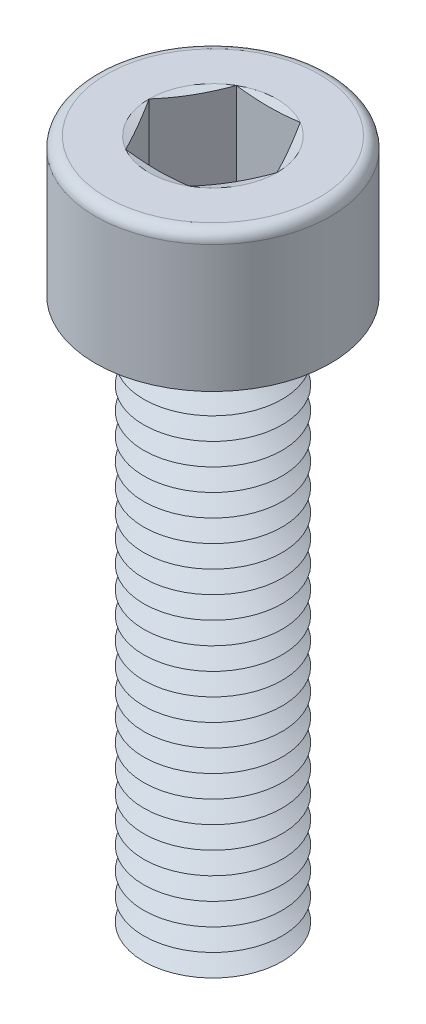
ISO-10303-21;
HEADER;
FILE_DESCRIPTION(('STEP AP214'),'2;1');
FILE_NAME('part.step','',(''),(''),'','','');
FILE_SCHEMA(('AUTOMOTIVE_DESIGN { 1 0 10303 214 1 1 1 1 }'));
ENDSEC;
DATA;
#1=APPLICATION_CONTEXT('core data for automotive mechanical design processes');
#2=APPLICATION_PROTOCOL_DEFINITION('international standard','automotive_design',2000,#1);
#3=PRODUCT_CONTEXT('',#1,'mechanical');
#4=PRODUCT('Part','Part','',(#3));
#5=PRODUCT_RELATED_PRODUCT_CATEGORY('part','',(#4));
#6=PRODUCT_DEFINITION_FORMATION('','',#4);
#7=PRODUCT_DEFINITION_CONTEXT('part definition',#1,'design');
#8=PRODUCT_DEFINITION('design','',#6,#7);
#9=PRODUCT_DEFINITION_SHAPE('','',#8);
#10=(LENGTH_UNIT() NAMED_UNIT(*) SI_UNIT(.MILLI.,.METRE.));
#11=(NAMED_UNIT(*) PLANE_ANGLE_UNIT() SI_UNIT($,.RADIAN.));
#12=(NAMED_UNIT(*) SI_UNIT($,.STERADIAN.) SOLID_ANGLE_UNIT());
#13=UNCERTAINTY_MEASURE_WITH_UNIT(LENGTH_MEASURE(1.E-05),#10,'distance_accuracy_value','');
#14=(GEOMETRIC_REPRESENTATION_CONTEXT(3) GLOBAL_UNCERTAINTY_ASSIGNED_CONTEXT((#13)) GLOBAL_UNIT_ASSIGNED_CONTEXT((#10,
#11,#12)) REPRESENTATION_CONTEXT('',''));
#15=CARTESIAN_POINT('',(0.,0.,0.));
#16=DIRECTION('',(0.,0.,1.));
#17=DIRECTION('',(1.,0.,0.));
#18=AXIS2_PLACEMENT_3D('',#15,#16,#17);
#19=CARTESIAN_POINT('',(0.,3.2,0.));
#20=DIRECTION('',(0.,1.,0.));
#21=DIRECTION('',(0.,0.,1.));
#22=AXIS2_PLACEMENT_3D('',#19,#20,#21);
#23=CONICAL_SURFACE('',#22,1.80717967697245,1.0471975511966);
#24=CARTESIAN_POINT('',(0.,3.6,0.));
#25=DIRECTION('',(0.,1.,0.));
#26=DIRECTION('',(0.,0.,1.));
#27=AXIS2_PLACEMENT_3D('',#24,#25,#26);
#28=CIRCLE('',#27,2.5);
#29=CARTESIAN_POINT('',(0.,3.6,2.5));
#30=VERTEX_POINT('',#29);
#31=EDGE_CURVE('E510',#30,#30,#28,.T.);
#32=ORIENTED_EDGE('',*,*,#31,.F.);
#33=EDGE_LOOP('',(#32));
#34=FACE_BOUND('',#33,.T.);
#35=CARTESIAN_POINT('',(0.,3.2,0.));
#36=DIRECTION('',(0.,1.,0.));
#37=DIRECTION('',(0.,0.,1.));
#38=AXIS2_PLACEMENT_3D('',#35,#36,#37);
#39=CIRCLE('',#38,1.80717967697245);
#40=CARTESIAN_POINT('',(0.,3.2,1.80717967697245));
#41=VERTEX_POINT('',#40);
#42=EDGE_CURVE('E514',#41,#41,#39,.T.);
#43=ORIENTED_EDGE('',*,*,#42,.T.);
#44=EDGE_LOOP('',(#43));
#45=FACE_BOUND('',#44,.T.);
#46=ADVANCED_FACE('F41',(#34,#45),#23,.T.);
#47=CARTESIAN_POINT('',(0.,2.8,0.));
#48=DIRECTION('',(0.,-1.,0.));
#49=DIRECTION('',(0.,0.,-1.));
#50=AXIS2_PLACEMENT_3D('',#47,#48,#49);
#51=CONICAL_SURFACE('',#50,2.5,1.0471975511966);
#52=ORIENTED_EDGE('',*,*,#42,.F.);
#53=EDGE_LOOP('',(#52));
#54=FACE_BOUND('',#53,.T.);
#55=CARTESIAN_POINT('',(0.,2.8,0.));
#56=DIRECTION('',(0.,1.,0.));
#57=DIRECTION('',(0.,0.,1.));
#58=AXIS2_PLACEMENT_3D('',#55,#56,#57);
#59=CIRCLE('',#58,2.5);
#60=CARTESIAN_POINT('',(0.,2.8,2.5));
#61=VERTEX_POINT('',#60);
#62=EDGE_CURVE('E518',#61,#61,#59,.T.);
#63=ORIENTED_EDGE('',*,*,#62,.T.);
#64=EDGE_LOOP('',(#63));
#65=FACE_BOUND('',#64,.T.);
#66=ADVANCED_FACE('F250',(#54,#65),#51,.T.);
#67=CARTESIAN_POINT('',(0.,0.,0.));
#68=DIRECTION('',(0.,1.,0.));
#69=DIRECTION('',(0.,0.,1.));
#70=AXIS2_PLACEMENT_3D('',#67,#68,#69);
#71=PLANE('',#70);
#72=CARTESIAN_POINT('',(0.,0.,0.));
#73=DIRECTION('',(0.,1.,0.));
#74=DIRECTION('',(0.,0.,1.));
#75=AXIS2_PLACEMENT_3D('',#72,#73,#74);
#76=CIRCLE('',#75,1.80717967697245);
#77=CARTESIAN_POINT('',(0.,0.,1.80717967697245));
#78=VERTEX_POINT('',#77);
#79=EDGE_CURVE('E546',#78,#78,#76,.T.);
#80=ORIENTED_EDGE('',*,*,#79,.F.);
#81=EDGE_LOOP('',(#80));
#82=FACE_BOUND('',#81,.T.);
#83=ADVANCED_FACE('F247',(#82),#71,.F.);
#84=CARTESIAN_POINT('',(0.,0.,0.));
#85=DIRECTION('',(0.,1.,0.));
#86=DIRECTION('',(0.,0.,1.));
#87=AXIS2_PLACEMENT_3D('',#84,#85,#86);
#88=CONICAL_SURFACE('',#87,1.80717967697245,1.0471975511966);
#89=CARTESIAN_POINT('',(0.,0.399999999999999,0.));
#90=DIRECTION('',(0.,1.,0.));
#91=DIRECTION('',(0.,0.,1.));
#92=AXIS2_PLACEMENT_3D('',#89,#90,#91);
#93=CIRCLE('',#92,2.5);
#94=CARTESIAN_POINT('',(0.,0.399999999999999,2.5));
#95=VERTEX_POINT('',#94);
#96=EDGE_CURVE('E542',#95,#95,#93,.T.);
#97=ORIENTED_EDGE('',*,*,#96,.F.);
#98=EDGE_LOOP('',(#97));
#99=FACE_BOUND('',#98,.T.);
#100=ORIENTED_EDGE('',*,*,#79,.T.);
#101=EDGE_LOOP('',(#100));
#102=FACE_BOUND('',#101,.T.);
#103=ADVANCED_FACE('F249',(#99,#102),#88,.T.);
#104=CARTESIAN_POINT('',(0.,0.399999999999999,0.));
#105=DIRECTION('',(0.,-1.,0.));
#106=DIRECTION('',(0.,0.,-1.));
#107=AXIS2_PLACEMENT_3D('',#104,#105,#106);
#108=CONICAL_SURFACE('',#107,2.5,1.0471975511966);
#109=CARTESIAN_POINT('',(0.,0.8,0.));
#110=DIRECTION('',(0.,1.,0.));
#111=DIRECTION('',(0.,0.,1.));
#112=AXIS2_PLACEMENT_3D('',#109,#110,#111);
#113=CIRCLE('',#112,1.80717967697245);
#114=CARTESIAN_POINT('',(0.,0.8,1.80717967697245));
#115=VERTEX_POINT('',#114);
#116=EDGE_CURVE('E538',#115,#115,#113,.T.);
#117=ORIENTED_EDGE('',*,*,#116,.F.);
#118=EDGE_LOOP('',(#117));
#119=FACE_BOUND('',#118,.T.);
#120=ORIENTED_EDGE('',*,*,#96,.T.);
#121=EDGE_LOOP('',(#120));
#122=FACE_BOUND('',#121,.T.);
#123=ADVANCED_FACE('F290',(#119,#122),#108,.T.);
#124=CARTESIAN_POINT('',(0.,0.8,0.));
#125=DIRECTION('',(0.,1.,0.));
#126=DIRECTION('',(0.,0.,1.));
#127=AXIS2_PLACEMENT_3D('',#124,#125,#126);
#128=CONICAL_SURFACE('',#127,1.80717967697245,1.0471975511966);
#129=CARTESIAN_POINT('',(0.,1.2,0.));
#130=DIRECTION('',(0.,1.,0.));
#131=DIRECTION('',(0.,0.,1.));
#132=AXIS2_PLACEMENT_3D('',#129,#130,#131);
#133=CIRCLE('',#132,2.5);
#134=CARTESIAN_POINT('',(0.,1.2,2.5));
#135=VERTEX_POINT('',#134);
#136=EDGE_CURVE('E534',#135,#135,#133,.T.);
#137=ORIENTED_EDGE('',*,*,#136,.F.);
#138=EDGE_LOOP('',(#137));
#139=FACE_BOUND('',#138,.T.);
#140=ORIENTED_EDGE('',*,*,#116,.T.);
#141=EDGE_LOOP('',(#140));
#142=FACE_BOUND('',#141,.T.);
#143=ADVANCED_FACE('F285',(#139,#142),#128,.T.);
#144=CARTESIAN_POINT('',(0.,1.2,0.));
#145=DIRECTION('',(0.,-1.,0.));
#146=DIRECTION('',(0.,0.,-1.));
#147=AXIS2_PLACEMENT_3D('',#144,#145,#146);
#148=CONICAL_SURFACE('',#147,2.5,1.0471975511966);
#149=CARTESIAN_POINT('',(0.,1.6,0.));
#150=DIRECTION('',(0.,1.,0.));
#151=DIRECTION('',(0.,0.,1.));
#152=AXIS2_PLACEMENT_3D('',#149,#150,#151);
#153=CIRCLE('',#152,1.80717967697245);
#154=CARTESIAN_POINT('',(0.,1.6,1.80717967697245));
#155=VERTEX_POINT('',#154);
#156=EDGE_CURVE('E530',#155,#155,#153,.T.);
#157=ORIENTED_EDGE('',*,*,#156,.F.);
#158=EDGE_LOOP('',(#157));
#159=FACE_BOUND('',#158,.T.);
#160=ORIENTED_EDGE('',*,*,#136,.T.);
#161=EDGE_LOOP('',(#160));
#162=FACE_BOUND('',#161,.T.);
#163=ADVANCED_FACE('F282',(#159,#162),#148,.T.);
#164=CARTESIAN_POINT('',(0.,1.6,0.));
#165=DIRECTION('',(0.,1.,0.));
#166=DIRECTION('',(0.,0.,1.));
#167=AXIS2_PLACEMENT_3D('',#164,#165,#166);
#168=CONICAL_SURFACE('',#167,1.80717967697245,1.0471975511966);
#169=CARTESIAN_POINT('',(0.,2.,0.));
#170=DIRECTION('',(0.,1.,0.));
#171=DIRECTION('',(0.,0.,1.));
#172=AXIS2_PLACEMENT_3D('',#169,#170,#171);
#173=CIRCLE('',#172,2.5);
#174=CARTESIAN_POINT('',(0.,2.,2.5));
#175=VERTEX_POINT('',#174);
#176=EDGE_CURVE('E526',#175,#175,#173,.T.);
#177=ORIENTED_EDGE('',*,*,#176,.F.);
#178=EDGE_LOOP('',(#177));
#179=FACE_BOUND('',#178,.T.);
#180=ORIENTED_EDGE('',*,*,#156,.T.);
#181=EDGE_LOOP('',(#180));
#182=FACE_BOUND('',#181,.T.);
#183=ADVANCED_FACE('F276',(#179,#182),#168,.T.);
#184=CARTESIAN_POINT('',(0.,2.,0.));
#185=DIRECTION('',(0.,-1.,0.));
#186=DIRECTION('',(0.,0.,-1.));
#187=AXIS2_PLACEMENT_3D('',#184,#185,#186);
#188=CONICAL_SURFACE('',#187,2.5,1.0471975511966);
#189=CARTESIAN_POINT('',(0.,2.4,0.));
#190=DIRECTION('',(0.,1.,0.));
#191=DIRECTION('',(0.,0.,1.));
#192=AXIS2_PLACEMENT_3D('',#189,#190,#191);
#193=CIRCLE('',#192,1.80717967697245);
#194=CARTESIAN_POINT('',(0.,2.4,1.80717967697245));
#195=VERTEX_POINT('',#194);
#196=EDGE_CURVE('E522',#195,#195,#193,.T.);
#197=ORIENTED_EDGE('',*,*,#196,.F.);
#198=EDGE_LOOP('',(#197));
#199=FACE_BOUND('',#198,.T.);
#200=ORIENTED_EDGE('',*,*,#176,.T.);
#201=EDGE_LOOP('',(#200));
#202=FACE_BOUND('',#201,.T.);
#203=ADVANCED_FACE('F272',(#199,#202),#188,.T.);
#204=CARTESIAN_POINT('',(0.,2.4,0.));
#205=DIRECTION('',(0.,1.,0.));
#206=DIRECTION('',(0.,0.,1.));
#207=AXIS2_PLACEMENT_3D('',#204,#205,#206);
#208=CONICAL_SURFACE('',#207,1.80717967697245,1.0471975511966);
#209=ORIENTED_EDGE('',*,*,#62,.F.);
#210=EDGE_LOOP('',(#209));
#211=FACE_BOUND('',#210,.T.);
#212=ORIENTED_EDGE('',*,*,#196,.T.);
#213=EDGE_LOOP('',(#212));
#214=FACE_BOUND('',#213,.T.);
#215=ADVANCED_FACE('F275',(#211,#214),#208,.T.);
#216=CARTESIAN_POINT('',(0.,4.,0.));
#217=DIRECTION('',(0.,1.,0.));
#218=DIRECTION('',(0.,0.,1.));
#219=AXIS2_PLACEMENT_3D('',#216,#217,#218);
#220=CONICAL_SURFACE('',#219,1.80717967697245,1.0471975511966);
#221=CARTESIAN_POINT('',(0.,4.4,0.));
#222=DIRECTION('',(0.,1.,0.));
#223=DIRECTION('',(0.,0.,1.));
#224=AXIS2_PLACEMENT_3D('',#221,#222,#223);
#225=CIRCLE('',#224,2.5);
#226=CARTESIAN_POINT('',(0.,4.4,2.5));
#227=VERTEX_POINT('',#226);
#228=EDGE_CURVE('E502',#227,#227,#225,.T.);
#229=ORIENTED_EDGE('',*,*,#228,.F.);
#230=EDGE_LOOP('',(#229));
#231=FACE_BOUND('',#230,.T.);
#232=CARTESIAN_POINT('',(0.,4.,0.));
#233=DIRECTION('',(0.,1.,0.));
#234=DIRECTION('',(0.,0.,1.));
#235=AXIS2_PLACEMENT_3D('',#232,#233,#234);
#236=CIRCLE('',#235,1.80717967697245);
#237=CARTESIAN_POINT('',(0.,4.,1.80717967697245));
#238=VERTEX_POINT('',#237);
#239=EDGE_CURVE('E506',#238,#238,#236,.T.);
#240=ORIENTED_EDGE('',*,*,#239,.T.);
#241=EDGE_LOOP('',(#240));
#242=FACE_BOUND('',#241,.T.);
#243=ADVANCED_FACE('F280',(#231,#242),#220,.T.);
#244=CARTESIAN_POINT('',(0.,3.6,0.));
#245=DIRECTION('',(0.,-1.,0.));
#246=DIRECTION('',(0.,0.,-1.));
#247=AXIS2_PLACEMENT_3D('',#244,#245,#246);
#248=CONICAL_SURFACE('',#247,2.5,1.0471975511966);
#249=ORIENTED_EDGE('',*,*,#239,.F.);
#250=EDGE_LOOP('',(#249));
#251=FACE_BOUND('',#250,.T.);
#252=ORIENTED_EDGE('',*,*,#31,.T.);
#253=EDGE_LOOP('',(#252));
#254=FACE_BOUND('',#253,.T.);
#255=ADVANCED_FACE('F786',(#251,#254),#248,.T.);
#256=CARTESIAN_POINT('',(0.,4.8,0.));
#257=DIRECTION('',(0.,1.,0.));
#258=DIRECTION('',(0.,0.,1.));
#259=AXIS2_PLACEMENT_3D('',#256,#257,#258);
#260=CONICAL_SURFACE('',#259,1.80717967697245,1.0471975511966);
#261=CARTESIAN_POINT('',(0.,5.2,0.));
#262=DIRECTION('',(0.,1.,0.));
#263=DIRECTION('',(0.,0.,1.));
#264=AXIS2_PLACEMENT_3D('',#261,#262,#263);
#265=CIRCLE('',#264,2.5);
#266=CARTESIAN_POINT('',(0.,5.2,2.5));
#267=VERTEX_POINT('',#266);
#268=EDGE_CURVE('E494',#267,#267,#265,.T.);
#269=ORIENTED_EDGE('',*,*,#268,.F.);
#270=EDGE_LOOP('',(#269));
#271=FACE_BOUND('',#270,.T.);
#272=CARTESIAN_POINT('',(0.,4.8,0.));
#273=DIRECTION('',(0.,1.,0.));
#274=DIRECTION('',(0.,0.,1.));
#275=AXIS2_PLACEMENT_3D('',#272,#273,#274);
#276=CIRCLE('',#275,1.80717967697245);
#277=CARTESIAN_POINT('',(0.,4.8,1.80717967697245));
#278=VERTEX_POINT('',#277);
#279=EDGE_CURVE('E498',#278,#278,#276,.T.);
#280=ORIENTED_EDGE('',*,*,#279,.T.);
#281=EDGE_LOOP('',(#280));
#282=FACE_BOUND('',#281,.T.);
#283=ADVANCED_FACE('F795',(#271,#282),#260,.T.);
#284=CARTESIAN_POINT('',(0.,4.4,0.));
#285=DIRECTION('',(0.,-1.,0.));
#286=DIRECTION('',(0.,0.,-1.));
#287=AXIS2_PLACEMENT_3D('',#284,#285,#286);
#288=CONICAL_SURFACE('',#287,2.5,1.0471975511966);
#289=ORIENTED_EDGE('',*,*,#279,.F.);
#290=EDGE_LOOP('',(#289));
#291=FACE_BOUND('',#290,.T.);
#292=ORIENTED_EDGE('',*,*,#228,.T.);
#293=EDGE_LOOP('',(#292));
#294=FACE_BOUND('',#293,.T.);
#295=ADVANCED_FACE('F805',(#291,#294),#288,.T.);
#296=CARTESIAN_POINT('',(0.,5.6,0.));
#297=DIRECTION('',(0.,1.,0.));
#298=DIRECTION('',(0.,0.,1.));
#299=AXIS2_PLACEMENT_3D('',#296,#297,#298);
#300=CONICAL_SURFACE('',#299,1.80717967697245,1.0471975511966);
#301=CARTESIAN_POINT('',(0.,6.,0.));
#302=DIRECTION('',(0.,1.,0.));
#303=DIRECTION('',(0.,0.,1.));
#304=AXIS2_PLACEMENT_3D('',#301,#302,#303);
#305=CIRCLE('',#304,2.5);
#306=CARTESIAN_POINT('',(0.,6.,2.5));
#307=VERTEX_POINT('',#306);
#308=EDGE_CURVE('E486',#307,#307,#305,.T.);
#309=ORIENTED_EDGE('',*,*,#308,.F.);
#310=EDGE_LOOP('',(#309));
#311=FACE_BOUND('',#310,.T.);
#312=CARTESIAN_POINT('',(0.,5.6,0.));
#313=DIRECTION('',(0.,1.,0.));
#314=DIRECTION('',(0.,0.,1.));
#315=AXIS2_PLACEMENT_3D('',#312,#313,#314);
#316=CIRCLE('',#315,1.80717967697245);
#317=CARTESIAN_POINT('',(0.,5.6,1.80717967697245));
#318=VERTEX_POINT('',#317);
#319=EDGE_CURVE('E490',#318,#318,#316,.T.);
#320=ORIENTED_EDGE('',*,*,#319,.T.);
#321=EDGE_LOOP('',(#320));
#322=FACE_BOUND('',#321,.T.);
#323=ADVANCED_FACE('F815',(#311,#322),#300,.T.);
#324=CARTESIAN_POINT('',(0.,5.2,0.));
#325=DIRECTION('',(0.,-1.,0.));
#326=DIRECTION('',(0.,0.,-1.));
#327=AXIS2_PLACEMENT_3D('',#324,#325,#326);
#328=CONICAL_SURFACE('',#327,2.5,1.0471975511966);
#329=ORIENTED_EDGE('',*,*,#319,.F.);
#330=EDGE_LOOP('',(#329));
#331=FACE_BOUND('',#330,.T.);
#332=ORIENTED_EDGE('',*,*,#268,.T.);
#333=EDGE_LOOP('',(#332));
#334=FACE_BOUND('',#333,.T.);
#335=ADVANCED_FACE('F825',(#331,#334),#328,.T.);
#336=CARTESIAN_POINT('',(0.,6.4,0.));
#337=DIRECTION('',(0.,1.,0.));
#338=DIRECTION('',(0.,0.,1.));
#339=AXIS2_PLACEMENT_3D('',#336,#337,#338);
#340=CONICAL_SURFACE('',#339,1.80717967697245,1.0471975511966);
#341=CARTESIAN_POINT('',(0.,6.8,0.));
#342=DIRECTION('',(0.,1.,0.));
#343=DIRECTION('',(0.,0.,1.));
#344=AXIS2_PLACEMENT_3D('',#341,#342,#343);
#345=CIRCLE('',#344,2.5);
#346=CARTESIAN_POINT('',(0.,6.8,2.5));
#347=VERTEX_POINT('',#346);
#348=EDGE_CURVE('E478',#347,#347,#345,.T.);
#349=ORIENTED_EDGE('',*,*,#348,.F.);
#350=EDGE_LOOP('',(#349));
#351=FACE_BOUND('',#350,.T.);
#352=CARTESIAN_POINT('',(0.,6.4,0.));
#353=DIRECTION('',(0.,1.,0.));
#354=DIRECTION('',(0.,0.,1.));
#355=AXIS2_PLACEMENT_3D('',#352,#353,#354);
#356=CIRCLE('',#355,1.80717967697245);
#357=CARTESIAN_POINT('',(0.,6.4,1.80717967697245));
#358=VERTEX_POINT('',#357);
#359=EDGE_CURVE('E482',#358,#358,#356,.T.);
#360=ORIENTED_EDGE('',*,*,#359,.T.);
#361=EDGE_LOOP('',(#360));
#362=FACE_BOUND('',#361,.T.);
#363=ADVANCED_FACE('F835',(#351,#362),#340,.T.);
#364=CARTESIAN_POINT('',(0.,6.,0.));
#365=DIRECTION('',(0.,-1.,0.));
#366=DIRECTION('',(0.,0.,-1.));
#367=AXIS2_PLACEMENT_3D('',#364,#365,#366);
#368=CONICAL_SURFACE('',#367,2.5,1.0471975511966);
#369=ORIENTED_EDGE('',*,*,#359,.F.);
#370=EDGE_LOOP('',(#369));
#371=FACE_BOUND('',#370,.T.);
#372=ORIENTED_EDGE('',*,*,#308,.T.);
#373=EDGE_LOOP('',(#372));
#374=FACE_BOUND('',#373,.T.);
#375=ADVANCED_FACE('F845',(#371,#374),#368,.T.);
#376=CARTESIAN_POINT('',(0.,7.2,0.));
#377=DIRECTION('',(0.,1.,0.));
#378=DIRECTION('',(0.,0.,1.));
#379=AXIS2_PLACEMENT_3D('',#376,#377,#378);
#380=CONICAL_SURFACE('',#379,1.80717967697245,1.0471975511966);
#381=CARTESIAN_POINT('',(0.,7.6,0.));
#382=DIRECTION('',(0.,1.,0.));
#383=DIRECTION('',(0.,0.,1.));
#384=AXIS2_PLACEMENT_3D('',#381,#382,#383);
#385=CIRCLE('',#384,2.5);
#386=CARTESIAN_POINT('',(0.,7.6,2.5));
#387=VERTEX_POINT('',#386);
#388=EDGE_CURVE('E470',#387,#387,#385,.T.);
#389=ORIENTED_EDGE('',*,*,#388,.F.);
#390=EDGE_LOOP('',(#389));
#391=FACE_BOUND('',#390,.T.);
#392=CARTESIAN_POINT('',(0.,7.2,0.));
#393=DIRECTION('',(0.,1.,0.));
#394=DIRECTION('',(0.,0.,1.));
#395=AXIS2_PLACEMENT_3D('',#392,#393,#394);
#396=CIRCLE('',#395,1.80717967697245);
#397=CARTESIAN_POINT('',(0.,7.2,1.80717967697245));
#398=VERTEX_POINT('',#397);
#399=EDGE_CURVE('E474',#398,#398,#396,.T.);
#400=ORIENTED_EDGE('',*,*,#399,.T.);
#401=EDGE_LOOP('',(#400));
#402=FACE_BOUND('',#401,.T.);
#403=ADVANCED_FACE('F855',(#391,#402),#380,.T.);
#404=CARTESIAN_POINT('',(0.,6.8,0.));
#405=DIRECTION('',(0.,-1.,0.));
#406=DIRECTION('',(0.,0.,-1.));
#407=AXIS2_PLACEMENT_3D('',#404,#405,#406);
#408=CONICAL_SURFACE('',#407,2.5,1.0471975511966);
#409=ORIENTED_EDGE('',*,*,#399,.F.);
#410=EDGE_LOOP('',(#409));
#411=FACE_BOUND('',#410,.T.);
#412=ORIENTED_EDGE('',*,*,#348,.T.);
#413=EDGE_LOOP('',(#412));
#414=FACE_BOUND('',#413,.T.);
#415=ADVANCED_FACE('F865',(#411,#414),#408,.T.);
#416=CARTESIAN_POINT('',(0.,8.,0.));
#417=DIRECTION('',(0.,1.,0.));
#418=DIRECTION('',(0.,0.,1.));
#419=AXIS2_PLACEMENT_3D('',#416,#417,#418);
#420=CONICAL_SURFACE('',#419,1.80717967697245,1.0471975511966);
#421=CARTESIAN_POINT('',(0.,8.4,0.));
#422=DIRECTION('',(0.,1.,0.));
#423=DIRECTION('',(0.,0.,1.));
#424=AXIS2_PLACEMENT_3D('',#421,#422,#423);
#425=CIRCLE('',#424,2.5);
#426=CARTESIAN_POINT('',(0.,8.4,2.5));
#427=VERTEX_POINT('',#426);
#428=EDGE_CURVE('E462',#427,#427,#425,.T.);
#429=ORIENTED_EDGE('',*,*,#428,.F.);
#430=EDGE_LOOP('',(#429));
#431=FACE_BOUND('',#430,.T.);
#432=CARTESIAN_POINT('',(0.,8.,0.));
#433=DIRECTION('',(0.,1.,0.));
#434=DIRECTION('',(0.,0.,1.));
#435=AXIS2_PLACEMENT_3D('',#432,#433,#434);
#436=CIRCLE('',#435,1.80717967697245);
#437=CARTESIAN_POINT('',(0.,8.,1.80717967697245));
#438=VERTEX_POINT('',#437);
#439=EDGE_CURVE('E466',#438,#438,#436,.T.);
#440=ORIENTED_EDGE('',*,*,#439,.T.);
#441=EDGE_LOOP('',(#440));
#442=FACE_BOUND('',#441,.T.);
#443=ADVANCED_FACE('F875',(#431,#442),#420,.T.);
#444=CARTESIAN_POINT('',(0.,7.6,0.));
#445=DIRECTION('',(0.,-1.,0.));
#446=DIRECTION('',(0.,0.,-1.));
#447=AXIS2_PLACEMENT_3D('',#444,#445,#446);
#448=CONICAL_SURFACE('',#447,2.5,1.0471975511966);
#449=ORIENTED_EDGE('',*,*,#439,.F.);
#450=EDGE_LOOP('',(#449));
#451=FACE_BOUND('',#450,.T.);
#452=ORIENTED_EDGE('',*,*,#388,.T.);
#453=EDGE_LOOP('',(#452));
#454=FACE_BOUND('',#453,.T.);
#455=ADVANCED_FACE('F885',(#451,#454),#448,.T.);
#456=CARTESIAN_POINT('',(0.,8.8,0.));
#457=DIRECTION('',(0.,1.,0.));
#458=DIRECTION('',(0.,0.,1.));
#459=AXIS2_PLACEMENT_3D('',#456,#457,#458);
#460=CONICAL_SURFACE('',#459,1.80717967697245,1.0471975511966);
#461=CARTESIAN_POINT('',(0.,9.2,0.));
#462=DIRECTION('',(0.,1.,0.));
#463=DIRECTION('',(0.,0.,1.));
#464=AXIS2_PLACEMENT_3D('',#461,#462,#463);
#465=CIRCLE('',#464,2.5);
#466=CARTESIAN_POINT('',(0.,9.2,2.5));
#467=VERTEX_POINT('',#466);
#468=EDGE_CURVE('E454',#467,#467,#465,.T.);
#469=ORIENTED_EDGE('',*,*,#468,.F.);
#470=EDGE_LOOP('',(#469));
#471=FACE_BOUND('',#470,.T.);
#472=CARTESIAN_POINT('',(0.,8.8,0.));
#473=DIRECTION('',(0.,1.,0.));
#474=DIRECTION('',(0.,0.,1.));
#475=AXIS2_PLACEMENT_3D('',#472,#473,#474);
#476=CIRCLE('',#475,1.80717967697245);
#477=CARTESIAN_POINT('',(0.,8.8,1.80717967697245));
#478=VERTEX_POINT('',#477);
#479=EDGE_CURVE('E458',#478,#478,#476,.T.);
#480=ORIENTED_EDGE('',*,*,#479,.T.);
#481=EDGE_LOOP('',(#480));
#482=FACE_BOUND('',#481,.T.);
#483=ADVANCED_FACE('F895',(#471,#482),#460,.T.);
#484=CARTESIAN_POINT('',(0.,8.4,0.));
#485=DIRECTION('',(0.,-1.,0.));
#486=DIRECTION('',(0.,0.,-1.));
#487=AXIS2_PLACEMENT_3D('',#484,#485,#486);
#488=CONICAL_SURFACE('',#487,2.5,1.0471975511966);
#489=ORIENTED_EDGE('',*,*,#479,.F.);
#490=EDGE_LOOP('',(#489));
#491=FACE_BOUND('',#490,.T.);
#492=ORIENTED_EDGE('',*,*,#428,.T.);
#493=EDGE_LOOP('',(#492));
#494=FACE_BOUND('',#493,.T.);
#495=ADVANCED_FACE('F905',(#491,#494),#488,.T.);
#496=CARTESIAN_POINT('',(0.,9.6,0.));
#497=DIRECTION('',(0.,1.,0.));
#498=DIRECTION('',(0.,0.,1.));
#499=AXIS2_PLACEMENT_3D('',#496,#497,#498);
#500=CONICAL_SURFACE('',#499,1.80717967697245,1.0471975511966);
#501=CARTESIAN_POINT('',(0.,10.,0.));
#502=DIRECTION('',(0.,1.,0.));
#503=DIRECTION('',(0.,0.,1.));
#504=AXIS2_PLACEMENT_3D('',#501,#502,#503);
#505=CIRCLE('',#504,2.5);
#506=CARTESIAN_POINT('',(0.,10.,2.5));
#507=VERTEX_POINT('',#506);
#508=EDGE_CURVE('E446',#507,#507,#505,.T.);
#509=ORIENTED_EDGE('',*,*,#508,.F.);
#510=EDGE_LOOP('',(#509));
#511=FACE_BOUND('',#510,.T.);
#512=CARTESIAN_POINT('',(0.,9.6,0.));
#513=DIRECTION('',(0.,1.,0.));
#514=DIRECTION('',(0.,0.,1.));
#515=AXIS2_PLACEMENT_3D('',#512,#513,#514);
#516=CIRCLE('',#515,1.80717967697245);
#517=CARTESIAN_POINT('',(0.,9.6,1.80717967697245));
#518=VERTEX_POINT('',#517);
#519=EDGE_CURVE('E450',#518,#518,#516,.T.);
#520=ORIENTED_EDGE('',*,*,#519,.T.);
#521=EDGE_LOOP('',(#520));
#522=FACE_BOUND('',#521,.T.);
#523=ADVANCED_FACE('F915',(#511,#522),#500,.T.);
#524=CARTESIAN_POINT('',(0.,9.2,0.));
#525=DIRECTION('',(0.,-1.,0.));
#526=DIRECTION('',(0.,0.,-1.));
#527=AXIS2_PLACEMENT_3D('',#524,#525,#526);
#528=CONICAL_SURFACE('',#527,2.5,1.0471975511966);
#529=ORIENTED_EDGE('',*,*,#519,.F.);
#530=EDGE_LOOP('',(#529));
#531=FACE_BOUND('',#530,.T.);
#532=ORIENTED_EDGE('',*,*,#468,.T.);
#533=EDGE_LOOP('',(#532));
#534=FACE_BOUND('',#533,.T.);
#535=ADVANCED_FACE('F925',(#531,#534),#528,.T.);
#536=CARTESIAN_POINT('',(0.,10.4,0.));
#537=DIRECTION('',(0.,1.,0.));
#538=DIRECTION('',(0.,0.,1.));
#539=AXIS2_PLACEMENT_3D('',#536,#537,#538);
#540=CONICAL_SURFACE('',#539,1.80717967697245,1.0471975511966);
#541=CARTESIAN_POINT('',(0.,10.8,0.));
#542=DIRECTION('',(0.,1.,0.));
#543=DIRECTION('',(0.,0.,1.));
#544=AXIS2_PLACEMENT_3D('',#541,#542,#543);
#545=CIRCLE('',#544,2.5);
#546=CARTESIAN_POINT('',(0.,10.8,2.5));
#547=VERTEX_POINT('',#546);
#548=EDGE_CURVE('E438',#547,#547,#545,.T.);
#549=ORIENTED_EDGE('',*,*,#548,.F.);
#550=EDGE_LOOP('',(#549));
#551=FACE_BOUND('',#550,.T.);
#552=CARTESIAN_POINT('',(0.,10.4,0.));
#553=DIRECTION('',(0.,1.,0.));
#554=DIRECTION('',(0.,0.,1.));
#555=AXIS2_PLACEMENT_3D('',#552,#553,#554);
#556=CIRCLE('',#555,1.80717967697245);
#557=CARTESIAN_POINT('',(0.,10.4,1.80717967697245));
#558=VERTEX_POINT('',#557);
#559=EDGE_CURVE('E442',#558,#558,#556,.T.);
#560=ORIENTED_EDGE('',*,*,#559,.T.);
#561=EDGE_LOOP('',(#560));
#562=FACE_BOUND('',#561,.T.);
#563=ADVANCED_FACE('F935',(#551,#562),#540,.T.);
#564=CARTESIAN_POINT('',(0.,10.,0.));
#565=DIRECTION('',(0.,-1.,0.));
#566=DIRECTION('',(0.,0.,-1.));
#567=AXIS2_PLACEMENT_3D('',#564,#565,#566);
#568=CONICAL_SURFACE('',#567,2.5,1.0471975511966);
#569=ORIENTED_EDGE('',*,*,#559,.F.);
#570=EDGE_LOOP('',(#569));
#571=FACE_BOUND('',#570,.T.);
#572=ORIENTED_EDGE('',*,*,#508,.T.);
#573=EDGE_LOOP('',(#572));
#574=FACE_BOUND('',#573,.T.);
#575=ADVANCED_FACE('F945',(#571,#574),#568,.T.);
#576=CARTESIAN_POINT('',(0.,11.2,0.));
#577=DIRECTION('',(0.,1.,0.));
#578=DIRECTION('',(0.,0.,1.));
#579=AXIS2_PLACEMENT_3D('',#576,#577,#578);
#580=CONICAL_SURFACE('',#579,1.80717967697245,1.0471975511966);
#581=CARTESIAN_POINT('',(0.,11.6,0.));
#582=DIRECTION('',(0.,1.,0.));
#583=DIRECTION('',(0.,0.,1.));
#584=AXIS2_PLACEMENT_3D('',#581,#582,#583);
#585=CIRCLE('',#584,2.5);
#586=CARTESIAN_POINT('',(0.,11.6,2.5));
#587=VERTEX_POINT('',#586);
#588=EDGE_CURVE('E430',#587,#587,#585,.T.);
#589=ORIENTED_EDGE('',*,*,#588,.F.);
#590=EDGE_LOOP('',(#589));
#591=FACE_BOUND('',#590,.T.);
#592=CARTESIAN_POINT('',(0.,11.2,0.));
#593=DIRECTION('',(0.,1.,0.));
#594=DIRECTION('',(0.,0.,1.));
#595=AXIS2_PLACEMENT_3D('',#592,#593,#594);
#596=CIRCLE('',#595,1.80717967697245);
#597=CARTESIAN_POINT('',(0.,11.2,1.80717967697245));
#598=VERTEX_POINT('',#597);
#599=EDGE_CURVE('E434',#598,#598,#596,.T.);
#600=ORIENTED_EDGE('',*,*,#599,.T.);
#601=EDGE_LOOP('',(#600));
#602=FACE_BOUND('',#601,.T.);
#603=ADVANCED_FACE('F955',(#591,#602),#580,.T.);
#604=CARTESIAN_POINT('',(0.,10.8,0.));
#605=DIRECTION('',(0.,-1.,0.));
#606=DIRECTION('',(0.,0.,-1.));
#607=AXIS2_PLACEMENT_3D('',#604,#605,#606);
#608=CONICAL_SURFACE('',#607,2.5,1.0471975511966);
#609=ORIENTED_EDGE('',*,*,#599,.F.);
#610=EDGE_LOOP('',(#609));
#611=FACE_BOUND('',#610,.T.);
#612=ORIENTED_EDGE('',*,*,#548,.T.);
#613=EDGE_LOOP('',(#612));
#614=FACE_BOUND('',#613,.T.);
#615=ADVANCED_FACE('F965',(#611,#614),#608,.T.);
#616=CARTESIAN_POINT('',(0.,12.,0.));
#617=DIRECTION('',(0.,1.,0.));
#618=DIRECTION('',(0.,0.,1.));
#619=AXIS2_PLACEMENT_3D('',#616,#617,#618);
#620=CONICAL_SURFACE('',#619,1.80717967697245,1.0471975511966);
#621=CARTESIAN_POINT('',(0.,12.4,0.));
#622=DIRECTION('',(0.,1.,0.));
#623=DIRECTION('',(0.,0.,1.));
#624=AXIS2_PLACEMENT_3D('',#621,#622,#623);
#625=CIRCLE('',#624,2.5);
#626=CARTESIAN_POINT('',(0.,12.4,2.5));
#627=VERTEX_POINT('',#626);
#628=EDGE_CURVE('E422',#627,#627,#625,.T.);
#629=ORIENTED_EDGE('',*,*,#628,.F.);
#630=EDGE_LOOP('',(#629));
#631=FACE_BOUND('',#630,.T.);
#632=CARTESIAN_POINT('',(0.,12.,0.));
#633=DIRECTION('',(0.,1.,0.));
#634=DIRECTION('',(0.,0.,1.));
#635=AXIS2_PLACEMENT_3D('',#632,#633,#634);
#636=CIRCLE('',#635,1.80717967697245);
#637=CARTESIAN_POINT('',(0.,12.,1.80717967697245));
#638=VERTEX_POINT('',#637);
#639=EDGE_CURVE('E426',#638,#638,#636,.T.);
#640=ORIENTED_EDGE('',*,*,#639,.T.);
#641=EDGE_LOOP('',(#640));
#642=FACE_BOUND('',#641,.T.);
#643=ADVANCED_FACE('F975',(#631,#642),#620,.T.);
#644=CARTESIAN_POINT('',(0.,11.6,0.));
#645=DIRECTION('',(0.,-1.,0.));
#646=DIRECTION('',(0.,0.,-1.));
#647=AXIS2_PLACEMENT_3D('',#644,#645,#646);
#648=CONICAL_SURFACE('',#647,2.5,1.0471975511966);
#649=ORIENTED_EDGE('',*,*,#639,.F.);
#650=EDGE_LOOP('',(#649));
#651=FACE_BOUND('',#650,.T.);
#652=ORIENTED_EDGE('',*,*,#588,.T.);
#653=EDGE_LOOP('',(#652));
#654=FACE_BOUND('',#653,.T.);
#655=ADVANCED_FACE('F985',(#651,#654),#648,.T.);
#656=CARTESIAN_POINT('',(0.,12.8,0.));
#657=DIRECTION('',(0.,1.,0.));
#658=DIRECTION('',(0.,0.,1.));
#659=AXIS2_PLACEMENT_3D('',#656,#657,#658);
#660=CONICAL_SURFACE('',#659,1.80717967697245,1.0471975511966);
#661=CARTESIAN_POINT('',(0.,13.2,0.));
#662=DIRECTION('',(0.,1.,0.));
#663=DIRECTION('',(0.,0.,1.));
#664=AXIS2_PLACEMENT_3D('',#661,#662,#663);
#665=CIRCLE('',#664,2.5);
#666=CARTESIAN_POINT('',(0.,13.2,2.5));
#667=VERTEX_POINT('',#666);
#668=EDGE_CURVE('E414',#667,#667,#665,.T.);
#669=ORIENTED_EDGE('',*,*,#668,.F.);
#670=EDGE_LOOP('',(#669));
#671=FACE_BOUND('',#670,.T.);
#672=CARTESIAN_POINT('',(0.,12.8,0.));
#673=DIRECTION('',(0.,1.,0.));
#674=DIRECTION('',(0.,0.,1.));
#675=AXIS2_PLACEMENT_3D('',#672,#673,#674);
#676=CIRCLE('',#675,1.80717967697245);
#677=CARTESIAN_POINT('',(0.,12.8,1.80717967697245));
#678=VERTEX_POINT('',#677);
#679=EDGE_CURVE('E418',#678,#678,#676,.T.);
#680=ORIENTED_EDGE('',*,*,#679,.T.);
#681=EDGE_LOOP('',(#680));
#682=FACE_BOUND('',#681,.T.);
#683=ADVANCED_FACE('F995',(#671,#682),#660,.T.);
#684=CARTESIAN_POINT('',(0.,12.4,0.));
#685=DIRECTION('',(0.,-1.,0.));
#686=DIRECTION('',(0.,0.,-1.));
#687=AXIS2_PLACEMENT_3D('',#684,#685,#686);
#688=CONICAL_SURFACE('',#687,2.5,1.0471975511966);
#689=ORIENTED_EDGE('',*,*,#679,.F.);
#690=EDGE_LOOP('',(#689));
#691=FACE_BOUND('',#690,.T.);
#692=ORIENTED_EDGE('',*,*,#628,.T.);
#693=EDGE_LOOP('',(#692));
#694=FACE_BOUND('',#693,.T.);
#695=ADVANCED_FACE('F1005',(#691,#694),#688,.T.);
#696=CARTESIAN_POINT('',(0.,13.6,0.));
#697=DIRECTION('',(0.,1.,0.));
#698=DIRECTION('',(0.,0.,1.));
#699=AXIS2_PLACEMENT_3D('',#696,#697,#698);
#700=CONICAL_SURFACE('',#699,1.80717967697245,1.0471975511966);
#701=CARTESIAN_POINT('',(0.,14.,0.));
#702=DIRECTION('',(0.,1.,0.));
#703=DIRECTION('',(0.,0.,1.));
#704=AXIS2_PLACEMENT_3D('',#701,#702,#703);
#705=CIRCLE('',#704,2.5);
#706=CARTESIAN_POINT('',(0.,14.,2.5));
#707=VERTEX_POINT('',#706);
#708=EDGE_CURVE('E406',#707,#707,#705,.T.);
#709=ORIENTED_EDGE('',*,*,#708,.F.);
#710=EDGE_LOOP('',(#709));
#711=FACE_BOUND('',#710,.T.);
#712=CARTESIAN_POINT('',(0.,13.6,0.));
#713=DIRECTION('',(0.,1.,0.));
#714=DIRECTION('',(0.,0.,1.));
#715=AXIS2_PLACEMENT_3D('',#712,#713,#714);
#716=CIRCLE('',#715,1.80717967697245);
#717=CARTESIAN_POINT('',(0.,13.6,1.80717967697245));
#718=VERTEX_POINT('',#717);
#719=EDGE_CURVE('E410',#718,#718,#716,.T.);
#720=ORIENTED_EDGE('',*,*,#719,.T.);
#721=EDGE_LOOP('',(#720));
#722=FACE_BOUND('',#721,.T.);
#723=ADVANCED_FACE('F1015',(#711,#722),#700,.T.);
#724=CARTESIAN_POINT('',(0.,13.2,0.));
#725=DIRECTION('',(0.,-1.,0.));
#726=DIRECTION('',(0.,0.,-1.));
#727=AXIS2_PLACEMENT_3D('',#724,#725,#726);
#728=CONICAL_SURFACE('',#727,2.5,1.0471975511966);
#729=ORIENTED_EDGE('',*,*,#719,.F.);
#730=EDGE_LOOP('',(#729));
#731=FACE_BOUND('',#730,.T.);
#732=ORIENTED_EDGE('',*,*,#668,.T.);
#733=EDGE_LOOP('',(#732));
#734=FACE_BOUND('',#733,.T.);
#735=ADVANCED_FACE('F1025',(#731,#734),#728,.T.);
#736=CARTESIAN_POINT('',(0.,14.4,0.));
#737=DIRECTION('',(0.,1.,0.));
#738=DIRECTION('',(0.,0.,1.));
#739=AXIS2_PLACEMENT_3D('',#736,#737,#738);
#740=CONICAL_SURFACE('',#739,1.80717967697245,1.0471975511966);
#741=CARTESIAN_POINT('',(0.,14.8,0.));
#742=DIRECTION('',(0.,1.,0.));
#743=DIRECTION('',(0.,0.,1.));
#744=AXIS2_PLACEMENT_3D('',#741,#742,#743);
#745=CIRCLE('',#744,2.5);
#746=CARTESIAN_POINT('',(0.,14.8,2.5));
#747=VERTEX_POINT('',#746);
#748=EDGE_CURVE('E398',#747,#747,#745,.T.);
#749=ORIENTED_EDGE('',*,*,#748,.F.);
#750=EDGE_LOOP('',(#749));
#751=FACE_BOUND('',#750,.T.);
#752=CARTESIAN_POINT('',(0.,14.4,0.));
#753=DIRECTION('',(0.,1.,0.));
#754=DIRECTION('',(0.,0.,1.));
#755=AXIS2_PLACEMENT_3D('',#752,#753,#754);
#756=CIRCLE('',#755,1.80717967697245);
#757=CARTESIAN_POINT('',(0.,14.4,1.80717967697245));
#758=VERTEX_POINT('',#757);
#759=EDGE_CURVE('E402',#758,#758,#756,.T.);
#760=ORIENTED_EDGE('',*,*,#759,.T.);
#761=EDGE_LOOP('',(#760));
#762=FACE_BOUND('',#761,.T.);
#763=ADVANCED_FACE('F1035',(#751,#762),#740,.T.);
#764=CARTESIAN_POINT('',(0.,14.,0.));
#765=DIRECTION('',(0.,-1.,0.));
#766=DIRECTION('',(0.,0.,-1.));
#767=AXIS2_PLACEMENT_3D('',#764,#765,#766);
#768=CONICAL_SURFACE('',#767,2.5,1.0471975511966);
#769=ORIENTED_EDGE('',*,*,#759,.F.);
#770=EDGE_LOOP('',(#769));
#771=FACE_BOUND('',#770,.T.);
#772=ORIENTED_EDGE('',*,*,#708,.T.);
#773=EDGE_LOOP('',(#772));
#774=FACE_BOUND('',#773,.T.);
#775=ADVANCED_FACE('F1045',(#771,#774),#768,.T.);
#776=CARTESIAN_POINT('',(0.,15.2,0.));
#777=DIRECTION('',(0.,1.,0.));
#778=DIRECTION('',(0.,0.,1.));
#779=AXIS2_PLACEMENT_3D('',#776,#777,#778);
#780=CONICAL_SURFACE('',#779,1.80717967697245,1.0471975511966);
#781=CARTESIAN_POINT('',(0.,15.6,0.));
#782=DIRECTION('',(0.,1.,0.));
#783=DIRECTION('',(0.,0.,1.));
#784=AXIS2_PLACEMENT_3D('',#781,#782,#783);
#785=CIRCLE('',#784,2.5);
#786=CARTESIAN_POINT('',(0.,15.6,2.5));
#787=VERTEX_POINT('',#786);
#788=EDGE_CURVE('E390',#787,#787,#785,.T.);
#789=ORIENTED_EDGE('',*,*,#788,.F.);
#790=EDGE_LOOP('',(#789));
#791=FACE_BOUND('',#790,.T.);
#792=CARTESIAN_POINT('',(0.,15.2,0.));
#793=DIRECTION('',(0.,1.,0.));
#794=DIRECTION('',(0.,0.,1.));
#795=AXIS2_PLACEMENT_3D('',#792,#793,#794);
#796=CIRCLE('',#795,1.80717967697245);
#797=CARTESIAN_POINT('',(0.,15.2,1.80717967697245));
#798=VERTEX_POINT('',#797);
#799=EDGE_CURVE('E394',#798,#798,#796,.T.);
#800=ORIENTED_EDGE('',*,*,#799,.T.);
#801=EDGE_LOOP('',(#800));
#802=FACE_BOUND('',#801,.T.);
#803=ADVANCED_FACE('F1055',(#791,#802),#780,.T.);
#804=CARTESIAN_POINT('',(0.,14.8,0.));
#805=DIRECTION('',(0.,-1.,0.));
#806=DIRECTION('',(0.,0.,-1.));
#807=AXIS2_PLACEMENT_3D('',#804,#805,#806);
#808=CONICAL_SURFACE('',#807,2.5,1.0471975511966);
#809=ORIENTED_EDGE('',*,*,#799,.F.);
#810=EDGE_LOOP('',(#809));
#811=FACE_BOUND('',#810,.T.);
#812=ORIENTED_EDGE('',*,*,#748,.T.);
#813=EDGE_LOOP('',(#812));
#814=FACE_BOUND('',#813,.T.);
#815=ADVANCED_FACE('F1065',(#811,#814),#808,.T.);
#816=CARTESIAN_POINT('',(0.,16.,0.));
#817=DIRECTION('',(0.,1.,0.));
#818=DIRECTION('',(0.,0.,1.));
#819=AXIS2_PLACEMENT_3D('',#816,#817,#818);
#820=CONICAL_SURFACE('',#819,1.80717967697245,1.0471975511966);
#821=CARTESIAN_POINT('',(0.,16.4,0.));
#822=DIRECTION('',(0.,1.,0.));
#823=DIRECTION('',(0.,0.,1.));
#824=AXIS2_PLACEMENT_3D('',#821,#822,#823);
#825=CIRCLE('',#824,2.5);
#826=CARTESIAN_POINT('',(0.,16.4,2.5));
#827=VERTEX_POINT('',#826);
#828=EDGE_CURVE('E383',#827,#827,#825,.T.);
#829=ORIENTED_EDGE('',*,*,#828,.F.);
#830=EDGE_LOOP('',(#829));
#831=FACE_BOUND('',#830,.T.);
#832=CARTESIAN_POINT('',(0.,16.,0.));
#833=DIRECTION('',(0.,1.,0.));
#834=DIRECTION('',(0.,0.,1.));
#835=AXIS2_PLACEMENT_3D('',#832,#833,#834);
#836=CIRCLE('',#835,1.80717967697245);
#837=CARTESIAN_POINT('',(0.,16.,1.80717967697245));
#838=VERTEX_POINT('',#837);
#839=EDGE_CURVE('E386',#838,#838,#836,.T.);
#840=ORIENTED_EDGE('',*,*,#839,.T.);
#841=EDGE_LOOP('',(#840));
#842=FACE_BOUND('',#841,.T.);
#843=ADVANCED_FACE('F1075',(#831,#842),#820,.T.);
#844=CARTESIAN_POINT('',(0.,15.6,0.));
#845=DIRECTION('',(0.,-1.,0.));
#846=DIRECTION('',(0.,0.,-1.));
#847=AXIS2_PLACEMENT_3D('',#844,#845,#846);
#848=CONICAL_SURFACE('',#847,2.5,1.0471975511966);
#849=ORIENTED_EDGE('',*,*,#839,.F.);
#850=EDGE_LOOP('',(#849));
#851=FACE_BOUND('',#850,.T.);
#852=ORIENTED_EDGE('',*,*,#788,.T.);
#853=EDGE_LOOP('',(#852));
#854=FACE_BOUND('',#853,.T.);
#855=ADVANCED_FACE('F1085',(#851,#854),#848,.T.);
#856=CARTESIAN_POINT('',(0.,16.8,0.));
#857=DIRECTION('',(0.,1.,0.));
#858=DIRECTION('',(0.,0.,1.));
#859=AXIS2_PLACEMENT_3D('',#856,#857,#858);
#860=CONICAL_SURFACE('',#859,1.80717967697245,1.0471975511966);
#861=CARTESIAN_POINT('',(0.,17.2,0.));
#862=DIRECTION('',(0.,1.,0.));
#863=DIRECTION('',(0.,0.,1.));
#864=AXIS2_PLACEMENT_3D('',#861,#862,#863);
#865=CIRCLE('',#864,2.5);
#866=CARTESIAN_POINT('',(0.,17.2,2.5));
#867=VERTEX_POINT('',#866);
#868=EDGE_CURVE('E375',#867,#867,#865,.T.);
#869=ORIENTED_EDGE('',*,*,#868,.F.);
#870=EDGE_LOOP('',(#869));
#871=FACE_BOUND('',#870,.T.);
#872=CARTESIAN_POINT('',(0.,16.8,0.));
#873=DIRECTION('',(0.,1.,0.));
#874=DIRECTION('',(0.,0.,1.));
#875=AXIS2_PLACEMENT_3D('',#872,#873,#874);
#876=CIRCLE('',#875,1.80717967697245);
#877=CARTESIAN_POINT('',(0.,16.8,1.80717967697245));
#878=VERTEX_POINT('',#877);
#879=EDGE_CURVE('E379',#878,#878,#876,.T.);
#880=ORIENTED_EDGE('',*,*,#879,.T.);
#881=EDGE_LOOP('',(#880));
#882=FACE_BOUND('',#881,.T.);
#883=ADVANCED_FACE('F1095',(#871,#882),#860,.T.);
#884=CARTESIAN_POINT('',(0.,16.4,0.));
#885=DIRECTION('',(0.,-1.,0.));
#886=DIRECTION('',(0.,0.,-1.));
#887=AXIS2_PLACEMENT_3D('',#884,#885,#886);
#888=CONICAL_SURFACE('',#887,2.5,1.0471975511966);
#889=ORIENTED_EDGE('',*,*,#879,.F.);
#890=EDGE_LOOP('',(#889));
#891=FACE_BOUND('',#890,.T.);
#892=ORIENTED_EDGE('',*,*,#828,.T.);
#893=EDGE_LOOP('',(#892));
#894=FACE_BOUND('',#893,.T.);
#895=ADVANCED_FACE('F1105',(#891,#894),#888,.T.);
#896=CARTESIAN_POINT('',(0.,17.6,0.));
#897=DIRECTION('',(0.,1.,0.));
#898=DIRECTION('',(0.,0.,1.));
#899=AXIS2_PLACEMENT_3D('',#896,#897,#898);
#900=CONICAL_SURFACE('',#899,1.80717967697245,1.0471975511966);
#901=CARTESIAN_POINT('',(0.,18.,0.));
#902=DIRECTION('',(0.,1.,0.));
#903=DIRECTION('',(0.,0.,1.));
#904=AXIS2_PLACEMENT_3D('',#901,#902,#903);
#905=CIRCLE('',#904,2.5);
#906=CARTESIAN_POINT('',(0.,18.,2.5));
#907=VERTEX_POINT('',#906);
#908=EDGE_CURVE('E367',#907,#907,#905,.T.);
#909=ORIENTED_EDGE('',*,*,#908,.F.);
#910=EDGE_LOOP('',(#909));
#911=FACE_BOUND('',#910,.T.);
#912=CARTESIAN_POINT('',(0.,17.6,0.));
#913=DIRECTION('',(0.,1.,0.));
#914=DIRECTION('',(0.,0.,1.));
#915=AXIS2_PLACEMENT_3D('',#912,#913,#914);
#916=CIRCLE('',#915,1.80717967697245);
#917=CARTESIAN_POINT('',(0.,17.6,1.80717967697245));
#918=VERTEX_POINT('',#917);
#919=EDGE_CURVE('E371',#918,#918,#916,.T.);
#920=ORIENTED_EDGE('',*,*,#919,.T.);
#921=EDGE_LOOP('',(#920));
#922=FACE_BOUND('',#921,.T.);
#923=ADVANCED_FACE('F1115',(#911,#922),#900,.T.);
#924=CARTESIAN_POINT('',(0.,17.2,0.));
#925=DIRECTION('',(0.,-1.,0.));
#926=DIRECTION('',(0.,0.,-1.));
#927=AXIS2_PLACEMENT_3D('',#924,#925,#926);
#928=CONICAL_SURFACE('',#927,2.5,1.0471975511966);
#929=ORIENTED_EDGE('',*,*,#919,.F.);
#930=EDGE_LOOP('',(#929));
#931=FACE_BOUND('',#930,.T.);
#932=ORIENTED_EDGE('',*,*,#868,.T.);
#933=EDGE_LOOP('',(#932));
#934=FACE_BOUND('',#933,.T.);
#935=ADVANCED_FACE('F1125',(#931,#934),#928,.T.);
#936=CARTESIAN_POINT('',(0.,18.4,0.));
#937=DIRECTION('',(0.,1.,0.));
#938=DIRECTION('',(0.,0.,1.));
#939=AXIS2_PLACEMENT_3D('',#936,#937,#938);
#940=CONICAL_SURFACE('',#939,1.80717967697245,1.0471975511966);
#941=CARTESIAN_POINT('',(0.,18.8,0.));
#942=DIRECTION('',(0.,1.,0.));
#943=DIRECTION('',(0.,0.,1.));
#944=AXIS2_PLACEMENT_3D('',#941,#942,#943);
#945=CIRCLE('',#944,2.5);
#946=CARTESIAN_POINT('',(0.,18.8,2.5));
#947=VERTEX_POINT('',#946);
#948=EDGE_CURVE('E351',#947,#947,#945,.T.);
#949=ORIENTED_EDGE('',*,*,#948,.F.);
#950=EDGE_LOOP('',(#949));
#951=FACE_BOUND('',#950,.T.);
#952=CARTESIAN_POINT('',(0.,18.4,0.));
#953=DIRECTION('',(0.,1.,0.));
#954=DIRECTION('',(0.,0.,1.));
#955=AXIS2_PLACEMENT_3D('',#952,#953,#954);
#956=CIRCLE('',#955,1.80717967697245);
#957=CARTESIAN_POINT('',(0.,18.4,1.80717967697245));
#958=VERTEX_POINT('',#957);
#959=EDGE_CURVE('E363',#958,#958,#956,.T.);
#960=ORIENTED_EDGE('',*,*,#959,.T.);
#961=EDGE_LOOP('',(#960));
#962=FACE_BOUND('',#961,.T.);
#963=ADVANCED_FACE('F1135',(#951,#962),#940,.T.);
#964=CARTESIAN_POINT('',(0.,18.,0.));
#965=DIRECTION('',(0.,-1.,0.));
#966=DIRECTION('',(0.,0.,-1.));
#967=AXIS2_PLACEMENT_3D('',#964,#965,#966);
#968=CONICAL_SURFACE('',#967,2.5,1.0471975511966);
#969=ORIENTED_EDGE('',*,*,#959,.F.);
#970=EDGE_LOOP('',(#969));
#971=FACE_BOUND('',#970,.T.);
#972=ORIENTED_EDGE('',*,*,#908,.T.);
#973=EDGE_LOOP('',(#972));
#974=FACE_BOUND('',#973,.T.);
#975=ADVANCED_FACE('F1145',(#971,#974),#968,.T.);
#976=CARTESIAN_POINT('',(0.,19.2,0.));
#977=DIRECTION('',(0.,1.,0.));
#978=DIRECTION('',(0.,0.,1.));
#979=AXIS2_PLACEMENT_3D('',#976,#977,#978);
#980=CONICAL_SURFACE('',#979,1.80717967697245,1.0471975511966);
#981=CARTESIAN_POINT('',(0.,19.6,0.));
#982=DIRECTION('',(0.,1.,0.));
#983=DIRECTION('',(0.,0.,1.));
#984=AXIS2_PLACEMENT_3D('',#981,#982,#983);
#985=CIRCLE('',#984,2.5);
#986=CARTESIAN_POINT('',(0.,19.6,2.5));
#987=VERTEX_POINT('',#986);
#988=EDGE_CURVE('E358',#987,#987,#985,.T.);
#989=ORIENTED_EDGE('',*,*,#988,.F.);
#990=EDGE_LOOP('',(#989));
#991=FACE_BOUND('',#990,.T.);
#992=CARTESIAN_POINT('',(0.,19.2,0.));
#993=DIRECTION('',(0.,1.,0.));
#994=DIRECTION('',(0.,0.,1.));
#995=AXIS2_PLACEMENT_3D('',#992,#993,#994);
#996=CIRCLE('',#995,1.80717967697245);
#997=CARTESIAN_POINT('',(0.,19.2,1.80717967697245));
#998=VERTEX_POINT('',#997);
#999=EDGE_CURVE('E347',#998,#998,#996,.T.);
#1000=ORIENTED_EDGE('',*,*,#999,.T.);
#1001=EDGE_LOOP('',(#1000));
#1002=FACE_BOUND('',#1001,.T.);
#1003=ADVANCED_FACE('F1155',(#991,#1002),#980,.T.);
#1004=CARTESIAN_POINT('',(0.,18.8,0.));
#1005=DIRECTION('',(0.,-1.,0.));
#1006=DIRECTION('',(0.,0.,-1.));
#1007=AXIS2_PLACEMENT_3D('',#1004,#1005,#1006);
#1008=CONICAL_SURFACE('',#1007,2.5,1.0471975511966);
#1009=ORIENTED_EDGE('',*,*,#999,.F.);
#1010=EDGE_LOOP('',(#1009));
#1011=FACE_BOUND('',#1010,.T.);
#1012=ORIENTED_EDGE('',*,*,#948,.T.);
#1013=EDGE_LOOP('',(#1012));
#1014=FACE_BOUND('',#1013,.T.);
#1015=ADVANCED_FACE('F194',(#1011,#1014),#1008,.T.);
#1016=CARTESIAN_POINT('',(0.,25.,0.));
#1017=DIRECTION('',(0.,1.,0.));
#1018=DIRECTION('',(0.,0.,1.));
#1019=AXIS2_PLACEMENT_3D('',#1016,#1017,#1018);
#1020=PLANE('',#1019);
#1021=CARTESIAN_POINT('',(0.,25.,0.));
#1022=DIRECTION('',(0.,1.,0.));
#1023=DIRECTION('',(0.,0.,1.));
#1024=AXIS2_PLACEMENT_3D('',#1021,#1022,#1023);
#1025=CIRCLE('',#1024,2.3094010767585);
#1026=CARTESIAN_POINT('',(1.15470053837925,25.,2.));
#1027=VERTEX_POINT('',#1026);
#1028=CARTESIAN_POINT('',(2.3094010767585,25.,0.));
#1029=VERTEX_POINT('',#1028);
#1030=EDGE_CURVE('E121',#1027,#1029,#1025,.T.);
#1031=ORIENTED_EDGE('',*,*,#1030,.F.);
#1032=CARTESIAN_POINT('',(0.,25.,0.));
#1033=DIRECTION('',(0.,1.,0.));
#1034=DIRECTION('',(0.,0.,1.));
#1035=AXIS2_PLACEMENT_3D('',#1032,#1033,#1034);
#1036=CIRCLE('',#1035,2.3094010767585);
#1037=CARTESIAN_POINT('',(-1.15470053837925,25.,2.));
#1038=VERTEX_POINT('',#1037);
#1039=EDGE_CURVE('E45',#1038,#1027,#1036,.T.);
#1040=ORIENTED_EDGE('',*,*,#1039,.F.);
#1041=CARTESIAN_POINT('',(-2.3094010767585,25.,0.));
#1042=VERTEX_POINT('',#1041);
#1043=EDGE_CURVE('E138',#1042,#1038,#1036,.T.);
#1044=ORIENTED_EDGE('',*,*,#1043,.F.);
#1045=CARTESIAN_POINT('',(-1.15470053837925,25.,-2.));
#1046=VERTEX_POINT('',#1045);
#1047=EDGE_CURVE('E621',#1046,#1042,#1036,.T.);
#1048=ORIENTED_EDGE('',*,*,#1047,.F.);
#1049=CARTESIAN_POINT('',(1.15470053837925,25.,-2.));
#1050=VERTEX_POINT('',#1049);
#1051=EDGE_CURVE('E51',#1050,#1046,#1036,.T.);
#1052=ORIENTED_EDGE('',*,*,#1051,.F.);
#1053=EDGE_CURVE('E11',#1029,#1050,#1036,.T.);
#1054=ORIENTED_EDGE('',*,*,#1053,.F.);
#1055=EDGE_LOOP('',(#1031,#1040,#1044,#1048,#1052,#1054));
#1056=FACE_BOUND('',#1055,.T.);
#1057=CARTESIAN_POINT('',(0.,25.,0.));
#1058=DIRECTION('',(0.,1.,0.));
#1059=DIRECTION('',(0.,0.,1.));
#1060=AXIS2_PLACEMENT_3D('',#1057,#1058,#1059);
#1061=CIRCLE('',#1060,3.85);
#1062=CARTESIAN_POINT('',(0.,25.,3.85));
#1063=VERTEX_POINT('',#1062);
#1064=EDGE_CURVE('E588',#1063,#1063,#1061,.T.);
#1065=ORIENTED_EDGE('',*,*,#1064,.T.);
#1066=EDGE_LOOP('',(#1065));
#1067=FACE_BOUND('',#1066,.T.);
#1068=ADVANCED_FACE('F140',(#1056,#1067),#1020,.T.);
#1069=CARTESIAN_POINT('',(0.,24.6,0.));
#1070=DIRECTION('',(0.,1.,0.));
#1071=DIRECTION('',(0.,0.,1.));
#1072=AXIS2_PLACEMENT_3D('',#1069,#1070,#1071);
#1073=TOROIDAL_SURFACE('',#1072,3.85,0.4);
#1074=CARTESIAN_POINT('',(0.,24.6,0.));
#1075=DIRECTION('',(0.,1.,0.));
#1076=DIRECTION('',(0.,0.,1.));
#1077=AXIS2_PLACEMENT_3D('',#1074,#1075,#1076);
#1078=CIRCLE('',#1077,4.25);
#1079=CARTESIAN_POINT('',(0.,24.6,4.25));
#1080=VERTEX_POINT('',#1079);
#1081=EDGE_CURVE('E592',#1080,#1080,#1078,.F.);
#1082=ORIENTED_EDGE('',*,*,#1081,.F.);
#1083=EDGE_LOOP('',(#1082));
#1084=FACE_BOUND('',#1083,.T.);
#1085=ORIENTED_EDGE('',*,*,#1064,.F.);
#1086=EDGE_LOOP('',(#1085));
#1087=FACE_BOUND('',#1086,.T.);
#1088=ADVANCED_FACE('F43',(#1084,#1087),#1073,.T.);
#1089=CARTESIAN_POINT('',(0.,25.,0.));
#1090=DIRECTION('',(0.,-1.,0.));
#1091=DIRECTION('',(0.,0.,-1.));
#1092=AXIS2_PLACEMENT_3D('',#1089,#1090,#1091);
#1093=CYLINDRICAL_SURFACE('',#1092,4.25);
#1094=ORIENTED_EDGE('',*,*,#1081,.T.);
#1095=EDGE_LOOP('',(#1094));
#1096=FACE_BOUND('',#1095,.T.);
#1097=CARTESIAN_POINT('',(0.,20.,0.));
#1098=DIRECTION('',(0.,1.,0.));
#1099=DIRECTION('',(0.,0.,1.));
#1100=AXIS2_PLACEMENT_3D('',#1097,#1098,#1099);
#1101=CIRCLE('',#1100,4.25);
#1102=CARTESIAN_POINT('',(0.,20.,4.25));
#1103=VERTEX_POINT('',#1102);
#1104=EDGE_CURVE('E576',#1103,#1103,#1101,.T.);
#1105=ORIENTED_EDGE('',*,*,#1104,.T.);
#1106=EDGE_LOOP('',(#1105));
#1107=FACE_BOUND('',#1106,.T.);
#1108=ADVANCED_FACE('F242',(#1096,#1107),#1093,.T.);
#1109=CARTESIAN_POINT('',(0.,20.,0.));
#1110=DIRECTION('',(0.,1.,0.));
#1111=DIRECTION('',(0.,0.,1.));
#1112=AXIS2_PLACEMENT_3D('',#1109,#1110,#1111);
#1113=PLANE('',#1112);
#1114=ORIENTED_EDGE('',*,*,#1104,.F.);
#1115=EDGE_LOOP('',(#1114));
#1116=FACE_BOUND('',#1115,.T.);
#1117=CARTESIAN_POINT('',(0.,20.,0.));
#1118=DIRECTION('',(0.,1.,0.));
#1119=DIRECTION('',(0.,0.,1.));
#1120=AXIS2_PLACEMENT_3D('',#1117,#1118,#1119);
#1121=CIRCLE('',#1120,2.5);
#1122=CARTESIAN_POINT('',(0.,20.,2.5));
#1123=VERTEX_POINT('',#1122);
#1124=EDGE_CURVE('E584',#1123,#1123,#1121,.T.);
#1125=ORIENTED_EDGE('',*,*,#1124,.T.);
#1126=EDGE_LOOP('',(#1125));
#1127=FACE_BOUND('',#1126,.T.);
#1128=ADVANCED_FACE('F238',(#1116,#1127),#1113,.F.);
#1129=CARTESIAN_POINT('',(0.,20.,0.));
#1130=DIRECTION('',(0.,-1.,0.));
#1131=DIRECTION('',(0.,0.,-1.));
#1132=AXIS2_PLACEMENT_3D('',#1129,#1130,#1131);
#1133=CYLINDRICAL_SURFACE('',#1132,2.5);
#1134=ORIENTED_EDGE('',*,*,#988,.T.);
#1135=EDGE_LOOP('',(#1134));
#1136=FACE_BOUND('',#1135,.T.);
#1137=ORIENTED_EDGE('',*,*,#1124,.F.);
#1138=EDGE_LOOP('',(#1137));
#1139=FACE_BOUND('',#1138,.T.);
#1140=ADVANCED_FACE('F241',(#1136,#1139),#1133,.T.);
#1141=CARTESIAN_POINT('',(0.,25.,0.));
#1142=DIRECTION('',(0.,1.,0.));
#1143=DIRECTION('',(0.,0.,1.));
#1144=AXIS2_PLACEMENT_3D('',#1141,#1142,#1143);
#1145=CONICAL_SURFACE('',#1144,2.3094010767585,1.30899693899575);
#1146=ORIENTED_EDGE('',*,*,#1039,.T.);
#1147=CARTESIAN_POINT('',(-3.01440758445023,25.3505168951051,2.));
#1148=CARTESIAN_POINT('',(-2.92409762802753,25.3303563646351,2.));
#1149=CARTESIAN_POINT('',(-2.83373054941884,25.3104525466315,2.));
#1150=CARTESIAN_POINT('',(-2.65285291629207,25.2712885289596,2.));
#1151=CARTESIAN_POINT('',(-2.562342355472,25.2520283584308,2.));
#1152=CARTESIAN_POINT('',(-2.2903798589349,25.195373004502,2.));
#1153=CARTESIAN_POINT('',(-2.10868043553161,25.159144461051,2.));
#1154=CARTESIAN_POINT('',(-1.74597297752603,25.0917168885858,2.));
#1155=CARTESIAN_POINT('',(-1.56497266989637,25.060476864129,2.));
#1156=CARTESIAN_POINT('',(-1.20186568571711,25.0051382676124,2.));
#1157=CARTESIAN_POINT('',(-1.01975924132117,24.9810382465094,2.));
#1158=CARTESIAN_POINT('',(-0.744747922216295,24.9525901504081,2.));
#1159=CARTESIAN_POINT('',(-0.652245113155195,24.9443671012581,2.));
#1160=CARTESIAN_POINT('',(-0.467020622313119,24.9309940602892,2.));
#1161=CARTESIAN_POINT('',(-0.374298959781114,24.925843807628,2.));
#1162=CARTESIAN_POINT('',(-0.188764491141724,24.9189154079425,2.));
#1163=CARTESIAN_POINT('',(-0.095951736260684,24.9171359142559,2.));
#1164=CARTESIAN_POINT('',(0.0896753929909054,24.9170578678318,2.));
#1165=CARTESIAN_POINT('',(0.182489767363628,24.9187593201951,2.));
#1166=CARTESIAN_POINT('',(0.368369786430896,24.9255489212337,2.));
#1167=CARTESIAN_POINT('',(0.461434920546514,24.9306507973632,2.));
#1168=CARTESIAN_POINT('',(0.647346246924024,24.943956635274,2.));
#1169=CARTESIAN_POINT('',(0.740192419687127,24.9521608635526,2.));
#1170=CARTESIAN_POINT('',(1.01841374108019,24.9808177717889,2.));
#1171=CARTESIAN_POINT('',(1.2033713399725,25.0053101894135,2.));
#1172=CARTESIAN_POINT('',(1.57694396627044,25.0623620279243,2.));
#1173=CARTESIAN_POINT('',(1.76552771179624,25.0951161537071,2.));
#1174=CARTESIAN_POINT('',(2.14178491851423,25.1655706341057,2.));
#1175=CARTESIAN_POINT('',(2.329458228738,25.2032717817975,2.));
#1176=CARTESIAN_POINT('',(2.70417911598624,25.2818831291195,2.));
#1177=CARTESIAN_POINT('',(2.89122649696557,25.3227942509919,2.));
#1178=CARTESIAN_POINT('',(3.26484478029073,25.4067429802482,2.));
#1179=CARTESIAN_POINT('',(3.45141567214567,25.4497806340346,2.));
#1180=CARTESIAN_POINT('',(3.82193813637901,25.5367817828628,2.));
#1181=CARTESIAN_POINT('',(4.00589388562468,25.580727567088,2.));
#1182=CARTESIAN_POINT('',(4.37356350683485,25.6696352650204,2.));
#1183=CARTESIAN_POINT('',(4.55727737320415,25.7145972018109,2.));
#1184=CARTESIAN_POINT('',(4.9242660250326,25.8051983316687,2.));
#1185=CARTESIAN_POINT('',(5.10754106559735,25.8508364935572,2.));
#1186=CARTESIAN_POINT('',(5.47394280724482,25.9426769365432,2.));
#1187=CARTESIAN_POINT('',(5.65706951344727,25.9888791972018,2.));
#1188=CARTESIAN_POINT('',(5.84014583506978,26.0352780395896,2.));
#1189=B_SPLINE_CURVE_WITH_KNOTS('',3,(#1147,#1148,#1149,#1150,#1151,#1152,#1153,#1154,#1155,
#1156,#1157,#1158,#1159,#1160,#1161,#1162,#1163,#1164,#1165,#1166,#1167,#1168,#1169,#1170,#1171,
#1172,#1173,#1174,#1175,#1176,#1177,#1178,#1179,#1180,#1181,#1182,#1183,#1184,#1185,#1186,#1187,
#1188),.UNSPECIFIED.,.F.,.F.,(4,2,2,2,2,2,2,2,2,2,2,2,2,2,2,2,2,2,2,2,4),(0.,0.277597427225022,
0.555207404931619,1.11099118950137,1.66194208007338,2.21278108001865,2.49134108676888,
2.7698774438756,3.04830249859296,3.3267279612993,3.60628428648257,3.88586463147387,
4.4453261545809,5.0194589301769,5.59368385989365,6.16807437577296,6.74247743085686,
7.30986991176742,7.87727529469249,8.44388991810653,9.01048407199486),.UNSPECIFIED.);
#1190=EDGE_CURVE('E127',#1038,#1027,#1189,.T.);
#1191=ORIENTED_EDGE('',*,*,#1190,.F.);
#1192=EDGE_LOOP('',(#1146,#1191));
#1193=FACE_BOUND('',#1192,.T.);
#1194=ADVANCED_FACE('F132',(#1193),#1145,.F.);
#1195=ORIENTED_EDGE('',*,*,#1043,.T.);
#1196=CARTESIAN_POINT('',(-2.30951654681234,25.0000309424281,-0.00020000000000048));
#1197=CARTESIAN_POINT('',(-2.26155517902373,24.9871729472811,0.0828715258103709));
#1198=CARTESIAN_POINT('',(-2.21350683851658,24.9754999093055,0.166093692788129));
#1199=CARTESIAN_POINT('',(-2.11724043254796,24.9549913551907,0.332831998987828));
#1200=CARTESIAN_POINT('',(-2.0690223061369,24.9461569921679,0.416348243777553));
#1201=CARTESIAN_POINT('',(-1.972708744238,24.931841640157,0.583168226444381));
#1202=CARTESIAN_POINT('',(-1.92461396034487,24.9263435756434,0.666470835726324));
#1203=CARTESIAN_POINT('',(-1.82836304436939,24.9189712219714,0.833182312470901));
#1204=CARTESIAN_POINT('',(-1.78020692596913,24.9170962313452,0.916591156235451));
#1205=CARTESIAN_POINT('',(-1.68389468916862,24.9170962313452,1.08340884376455));
#1206=CARTESIAN_POINT('',(-1.63573857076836,24.9189712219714,1.1668176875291));
#1207=CARTESIAN_POINT('',(-1.53948765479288,24.9263435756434,1.33352916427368));
#1208=CARTESIAN_POINT('',(-1.49139287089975,24.931841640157,1.41683177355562));
#1209=CARTESIAN_POINT('',(-1.39507930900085,24.9461569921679,1.58365175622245));
#1210=CARTESIAN_POINT('',(-1.3468611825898,24.9549913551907,1.66716800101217));
#1211=CARTESIAN_POINT('',(-1.25059477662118,24.9754999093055,1.83390630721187));
#1212=CARTESIAN_POINT('',(-1.20254643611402,24.9871729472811,1.91712847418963));
#1213=CARTESIAN_POINT('',(-1.15458506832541,25.0000309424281,2.0002));
#1214=B_SPLINE_CURVE_WITH_KNOTS('',3,(#1196,#1197,#1198,#1199,#1200,#1201,#1202,#1203,#1204,
#1205,#1206,#1207,#1208,#1209,#1210,#1211,#1212,#1213),.UNSPECIFIED.,.F.,.F.,(4,2,2,2,2,2,2,2,
4),(0.,0.290357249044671,0.580832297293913,0.869807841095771,1.15872743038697,1.44764701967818,
1.73662256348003,2.02709761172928,2.31745486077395),.UNSPECIFIED.);
#1215=EDGE_CURVE('E163',#1042,#1038,#1214,.T.);
#1216=ORIENTED_EDGE('',*,*,#1215,.F.);
#1217=EDGE_LOOP('',(#1195,#1216));
#1218=FACE_BOUND('',#1217,.T.);
#1219=ADVANCED_FACE('F257',(#1218),#1145,.F.);
#1220=ORIENTED_EDGE('',*,*,#1047,.T.);
#1221=CARTESIAN_POINT('',(-1.15458506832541,25.0000309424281,-2.0002));
#1222=CARTESIAN_POINT('',(-1.20254643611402,24.9871729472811,-1.91712847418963));
#1223=CARTESIAN_POINT('',(-1.25059477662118,24.9754999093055,-1.83390630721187));
#1224=CARTESIAN_POINT('',(-1.3468611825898,24.9549913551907,-1.66716800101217));
#1225=CARTESIAN_POINT('',(-1.39507930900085,24.9461569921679,-1.58365175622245));
#1226=CARTESIAN_POINT('',(-1.49139287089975,24.931841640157,-1.41683177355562));
#1227=CARTESIAN_POINT('',(-1.53948765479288,24.9263435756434,-1.33352916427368));
#1228=CARTESIAN_POINT('',(-1.63573857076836,24.9189712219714,-1.1668176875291));
#1229=CARTESIAN_POINT('',(-1.68389468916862,24.9170962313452,-1.08340884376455));
#1230=CARTESIAN_POINT('',(-1.78020692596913,24.9170962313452,-0.916591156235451));
#1231=CARTESIAN_POINT('',(-1.82836304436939,24.9189712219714,-0.833182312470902));
#1232=CARTESIAN_POINT('',(-1.92461396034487,24.9263435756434,-0.666470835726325));
#1233=CARTESIAN_POINT('',(-1.972708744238,24.931841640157,-0.583168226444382));
#1234=CARTESIAN_POINT('',(-2.0690223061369,24.9461569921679,-0.416348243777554));
#1235=CARTESIAN_POINT('',(-2.11724043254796,24.9549913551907,-0.332831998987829));
#1236=CARTESIAN_POINT('',(-2.21350683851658,24.9754999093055,-0.16609369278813));
#1237=CARTESIAN_POINT('',(-2.26155517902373,24.9871729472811,-0.082871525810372));
#1238=CARTESIAN_POINT('',(-2.30951654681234,25.0000309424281,0.000199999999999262));
#1239=B_SPLINE_CURVE_WITH_KNOTS('',3,(#1221,#1222,#1223,#1224,#1225,#1226,#1227,#1228,#1229,
#1230,#1231,#1232,#1233,#1234,#1235,#1236,#1237,#1238),.UNSPECIFIED.,.F.,.F.,(4,2,2,2,2,2,2,2,
4),(0.,0.29035724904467,0.580832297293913,0.869807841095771,1.15872743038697,1.44764701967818,
1.73662256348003,2.02709761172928,2.31745486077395),.UNSPECIFIED.);
#1240=EDGE_CURVE('E63',#1046,#1042,#1239,.T.);
#1241=ORIENTED_EDGE('',*,*,#1240,.F.);
#1242=EDGE_LOOP('',(#1220,#1241));
#1243=FACE_BOUND('',#1242,.T.);
#1244=ADVANCED_FACE('F192',(#1243),#1145,.F.);
#1245=ORIENTED_EDGE('',*,*,#1051,.T.);
#1246=CARTESIAN_POINT('',(-3.01440758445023,25.3505168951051,-2.));
#1247=CARTESIAN_POINT('',(-2.92409762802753,25.3303563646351,-2.));
#1248=CARTESIAN_POINT('',(-2.83373054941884,25.3104525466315,-2.));
#1249=CARTESIAN_POINT('',(-2.65285291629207,25.2712885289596,-2.));
#1250=CARTESIAN_POINT('',(-2.56234235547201,25.2520283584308,-2.));
#1251=CARTESIAN_POINT('',(-2.2903798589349,25.195373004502,-2.));
#1252=CARTESIAN_POINT('',(-2.10868043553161,25.159144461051,-2.));
#1253=CARTESIAN_POINT('',(-1.74597297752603,25.0917168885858,-2.));
#1254=CARTESIAN_POINT('',(-1.56497266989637,25.060476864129,-2.));
#1255=CARTESIAN_POINT('',(-1.20186568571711,25.0051382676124,-2.));
#1256=CARTESIAN_POINT('',(-1.01975924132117,24.9810382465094,-2.));
#1257=CARTESIAN_POINT('',(-0.744747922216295,24.9525901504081,-2.));
#1258=CARTESIAN_POINT('',(-0.652245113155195,24.9443671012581,-2.));
#1259=CARTESIAN_POINT('',(-0.46702062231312,24.9309940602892,-2.));
#1260=CARTESIAN_POINT('',(-0.374298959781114,24.925843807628,-2.));
#1261=CARTESIAN_POINT('',(-0.188764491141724,24.9189154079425,-2.));
#1262=CARTESIAN_POINT('',(-0.095951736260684,24.9171359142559,-2.));
#1263=CARTESIAN_POINT('',(0.0896753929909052,24.9170578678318,-2.));
#1264=CARTESIAN_POINT('',(0.182489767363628,24.9187593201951,-2.));
#1265=CARTESIAN_POINT('',(0.368369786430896,24.9255489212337,-2.));
#1266=CARTESIAN_POINT('',(0.461434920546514,24.9306507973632,-2.));
#1267=CARTESIAN_POINT('',(0.647346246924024,24.943956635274,-2.));
#1268=CARTESIAN_POINT('',(0.740192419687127,24.9521608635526,-2.));
#1269=CARTESIAN_POINT('',(1.01841374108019,24.9808177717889,-2.));
#1270=CARTESIAN_POINT('',(1.2033713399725,25.0053101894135,-2.));
#1271=CARTESIAN_POINT('',(1.57694396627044,25.0623620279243,-2.));
#1272=CARTESIAN_POINT('',(1.76552771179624,25.0951161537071,-2.));
#1273=CARTESIAN_POINT('',(2.14178491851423,25.1655706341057,-2.));
#1274=CARTESIAN_POINT('',(2.329458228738,25.2032717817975,-2.));
#1275=CARTESIAN_POINT('',(2.70417911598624,25.2818831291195,-2.));
#1276=CARTESIAN_POINT('',(2.89122649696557,25.3227942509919,-2.));
#1277=CARTESIAN_POINT('',(3.26484478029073,25.4067429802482,-2.));
#1278=CARTESIAN_POINT('',(3.45141567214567,25.4497806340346,-2.));
#1279=CARTESIAN_POINT('',(3.82193813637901,25.5367817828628,-2.));
#1280=CARTESIAN_POINT('',(4.00589388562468,25.580727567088,-2.));
#1281=CARTESIAN_POINT('',(4.37356350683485,25.6696352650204,-2.));
#1282=CARTESIAN_POINT('',(4.55727737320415,25.7145972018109,-2.));
#1283=CARTESIAN_POINT('',(4.9242660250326,25.8051983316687,-2.));
#1284=CARTESIAN_POINT('',(5.10754106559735,25.8508364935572,-2.));
#1285=CARTESIAN_POINT('',(5.47394280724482,25.9426769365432,-2.));
#1286=CARTESIAN_POINT('',(5.65706951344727,25.9888791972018,-2.));
#1287=CARTESIAN_POINT('',(5.84014583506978,26.0352780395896,-2.));
#1288=B_SPLINE_CURVE_WITH_KNOTS('',3,(#1246,#1247,#1248,#1249,#1250,#1251,#1252,#1253,#1254,
#1255,#1256,#1257,#1258,#1259,#1260,#1261,#1262,#1263,#1264,#1265,#1266,#1267,#1268,#1269,#1270,
#1271,#1272,#1273,#1274,#1275,#1276,#1277,#1278,#1279,#1280,#1281,#1282,#1283,#1284,#1285,#1286,
#1287),.UNSPECIFIED.,.F.,.F.,(4,2,2,2,2,2,2,2,2,2,2,2,2,2,2,2,2,2,2,2,4),(0.,0.277597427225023,
0.555207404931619,1.11099118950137,1.66194208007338,2.21278108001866,2.49134108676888,
2.7698774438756,3.04830249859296,3.3267279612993,3.60628428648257,3.88586463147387,
4.4453261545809,5.0194589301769,5.59368385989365,6.16807437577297,6.74247743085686,
7.30986991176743,7.87727529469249,8.44388991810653,9.01048407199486),.UNSPECIFIED.);
#1289=EDGE_CURVE('E213',#1050,#1046,#1288,.F.);
#1290=ORIENTED_EDGE('',*,*,#1289,.F.);
#1291=EDGE_LOOP('',(#1245,#1290));
#1292=FACE_BOUND('',#1291,.T.);
#1293=ADVANCED_FACE('F187',(#1292),#1145,.F.);
#1294=ORIENTED_EDGE('',*,*,#1053,.T.);
#1295=CARTESIAN_POINT('',(2.30951654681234,25.0000309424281,0.000199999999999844));
#1296=CARTESIAN_POINT('',(2.26155517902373,24.9871729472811,-0.0828715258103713));
#1297=CARTESIAN_POINT('',(2.21350683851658,24.9754999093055,-0.166093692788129));
#1298=CARTESIAN_POINT('',(2.11724043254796,24.9549913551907,-0.332831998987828));
#1299=CARTESIAN_POINT('',(2.06902230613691,24.9461569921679,-0.416348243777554));
#1300=CARTESIAN_POINT('',(1.972708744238,24.931841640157,-0.583168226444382));
#1301=CARTESIAN_POINT('',(1.92461396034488,24.9263435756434,-0.666470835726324));
#1302=CARTESIAN_POINT('',(1.82836304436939,24.9189712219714,-0.833182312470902));
#1303=CARTESIAN_POINT('',(1.78020692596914,24.9170962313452,-0.916591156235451));
#1304=CARTESIAN_POINT('',(1.68389468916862,24.9170962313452,-1.08340884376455));
#1305=CARTESIAN_POINT('',(1.63573857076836,24.9189712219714,-1.1668176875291));
#1306=CARTESIAN_POINT('',(1.53948765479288,24.9263435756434,-1.33352916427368));
#1307=CARTESIAN_POINT('',(1.49139287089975,24.931841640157,-1.41683177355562));
#1308=CARTESIAN_POINT('',(1.39507930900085,24.9461569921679,-1.58365175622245));
#1309=CARTESIAN_POINT('',(1.3468611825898,24.9549913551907,-1.66716800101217));
#1310=CARTESIAN_POINT('',(1.25059477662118,24.9754999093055,-1.83390630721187));
#1311=CARTESIAN_POINT('',(1.20254643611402,24.9871729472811,-1.91712847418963));
#1312=CARTESIAN_POINT('',(1.15458506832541,25.0000309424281,-2.0002));
#1313=B_SPLINE_CURVE_WITH_KNOTS('',3,(#1295,#1296,#1297,#1298,#1299,#1300,#1301,#1302,#1303,
#1304,#1305,#1306,#1307,#1308,#1309,#1310,#1311,#1312),.UNSPECIFIED.,.F.,.F.,(4,2,2,2,2,2,2,2,
4),(0.,0.290357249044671,0.580832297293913,0.869807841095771,1.15872743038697,1.44764701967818,
1.73662256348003,2.02709761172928,2.31745486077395),.UNSPECIFIED.);
#1314=EDGE_CURVE('E56',#1029,#1050,#1313,.T.);
#1315=ORIENTED_EDGE('',*,*,#1314,.F.);
#1316=EDGE_LOOP('',(#1294,#1315));
#1317=FACE_BOUND('',#1316,.T.);
#1318=ADVANCED_FACE('F191',(#1317),#1145,.F.);
#1319=ORIENTED_EDGE('',*,*,#1030,.T.);
#1320=CARTESIAN_POINT('',(1.15458506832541,25.0000309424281,2.0002));
#1321=CARTESIAN_POINT('',(1.20254643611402,24.9871729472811,1.91712847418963));
#1322=CARTESIAN_POINT('',(1.25059477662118,24.9754999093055,1.83390630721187));
#1323=CARTESIAN_POINT('',(1.3468611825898,24.9549913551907,1.66716800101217));
#1324=CARTESIAN_POINT('',(1.39507930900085,24.9461569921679,1.58365175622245));
#1325=CARTESIAN_POINT('',(1.49139287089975,24.931841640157,1.41683177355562));
#1326=CARTESIAN_POINT('',(1.53948765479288,24.9263435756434,1.33352916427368));
#1327=CARTESIAN_POINT('',(1.63573857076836,24.9189712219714,1.1668176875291));
#1328=CARTESIAN_POINT('',(1.68389468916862,24.9170962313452,1.08340884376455));
#1329=CARTESIAN_POINT('',(1.78020692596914,24.9170962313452,0.916591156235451));
#1330=CARTESIAN_POINT('',(1.82836304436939,24.9189712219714,0.833182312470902));
#1331=CARTESIAN_POINT('',(1.92461396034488,24.9263435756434,0.666470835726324));
#1332=CARTESIAN_POINT('',(1.972708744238,24.931841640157,0.583168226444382));
#1333=CARTESIAN_POINT('',(2.06902230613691,24.9461569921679,0.416348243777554));
#1334=CARTESIAN_POINT('',(2.11724043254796,24.9549913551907,0.332831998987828));
#1335=CARTESIAN_POINT('',(2.21350683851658,24.9754999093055,0.166093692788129));
#1336=CARTESIAN_POINT('',(2.26155517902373,24.9871729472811,0.0828715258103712));
#1337=CARTESIAN_POINT('',(2.30951654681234,25.0000309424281,-0.000200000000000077));
#1338=B_SPLINE_CURVE_WITH_KNOTS('',3,(#1320,#1321,#1322,#1323,#1324,#1325,#1326,#1327,#1328,
#1329,#1330,#1331,#1332,#1333,#1334,#1335,#1336,#1337),.UNSPECIFIED.,.F.,.F.,(4,2,2,2,2,2,2,2,
4),(0.,0.290357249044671,0.580832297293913,0.869807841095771,1.15872743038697,1.44764701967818,
1.73662256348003,2.02709761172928,2.31745486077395),.UNSPECIFIED.);
#1339=EDGE_CURVE('E117',#1027,#1029,#1338,.T.);
#1340=ORIENTED_EDGE('',*,*,#1339,.F.);
#1341=EDGE_LOOP('',(#1319,#1340));
#1342=FACE_BOUND('',#1341,.T.);
#1343=ADVANCED_FACE('F119',(#1342),#1145,.F.);
#1344=CARTESIAN_POINT('',(0.,21.,0.));
#1345=DIRECTION('',(0.,1.,0.));
#1346=DIRECTION('',(0.,0.,1.));
#1347=AXIS2_PLACEMENT_3D('',#1344,#1345,#1346);
#1348=CONICAL_SURFACE('',#1347,2.,1.0471975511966);
#1349=CARTESIAN_POINT('',(0.,19.8452994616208,0.));
#1350=VERTEX_POINT('',#1349);
#1351=VERTEX_LOOP('',#1350);
#1352=FACE_BOUND('',#1351,.T.);
#1353=CARTESIAN_POINT('',(0.,21.,0.));
#1354=DIRECTION('',(0.,1.,0.));
#1355=DIRECTION('',(0.,0.,1.));
#1356=AXIS2_PLACEMENT_3D('',#1353,#1354,#1355);
#1357=CIRCLE('',#1356,2.);
#1358=CARTESIAN_POINT('',(0.,21.,2.));
#1359=VERTEX_POINT('',#1358);
#1360=CARTESIAN_POINT('',(1.73205080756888,21.,1.));
#1361=VERTEX_POINT('',#1360);
#1362=EDGE_CURVE('E550',#1359,#1361,#1357,.T.);
#1363=ORIENTED_EDGE('',*,*,#1362,.T.);
#1364=CARTESIAN_POINT('',(0.,21.,0.));
#1365=DIRECTION('',(0.,1.,0.));
#1366=DIRECTION('',(0.,0.,1.));
#1367=AXIS2_PLACEMENT_3D('',#1364,#1365,#1366);
#1368=CIRCLE('',#1367,2.);
#1369=CARTESIAN_POINT('',(1.73205080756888,21.,-0.999999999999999));
#1370=VERTEX_POINT('',#1369);
#1371=EDGE_CURVE('E139',#1361,#1370,#1368,.T.);
#1372=ORIENTED_EDGE('',*,*,#1371,.T.);
#1373=CARTESIAN_POINT('',(0.,21.,-2.));
#1374=VERTEX_POINT('',#1373);
#1375=EDGE_CURVE('E605',#1370,#1374,#1368,.T.);
#1376=ORIENTED_EDGE('',*,*,#1375,.T.);
#1377=CARTESIAN_POINT('',(-1.73205080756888,21.,-0.999999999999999));
#1378=VERTEX_POINT('',#1377);
#1379=EDGE_CURVE('E603',#1374,#1378,#1368,.T.);
#1380=ORIENTED_EDGE('',*,*,#1379,.T.);
#1381=CARTESIAN_POINT('',(-1.73205080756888,21.,1.));
#1382=VERTEX_POINT('',#1381);
#1383=EDGE_CURVE('E597',#1378,#1382,#1368,.T.);
#1384=ORIENTED_EDGE('',*,*,#1383,.T.);
#1385=EDGE_CURVE('E595',#1382,#1359,#1368,.T.);
#1386=ORIENTED_EDGE('',*,*,#1385,.T.);
#1387=EDGE_LOOP('',(#1363,#1372,#1376,#1380,#1384,#1386));
#1388=FACE_BOUND('',#1387,.T.);
#1389=ADVANCED_FACE('F300',(#1352,#1388),#1348,.F.);
#1390=CARTESIAN_POINT('',(1.15470053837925,21.,-2.));
#1391=DIRECTION('',(0.,1.,0.));
#1392=DIRECTION('',(0.,0.,1.));
#1393=AXIS2_PLACEMENT_3D('',#1390,#1391,#1392);
#1394=PLANE('',#1393);
#1395=ORIENTED_EDGE('',*,*,#1379,.F.);
#1396=DIRECTION('',(-1.,0.,0.));
#1397=VECTOR('',#1396,1.);
#1398=CARTESIAN_POINT('',(1.15470053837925,21.,-2.));
#1399=LINE('',#1398,#1397);
#1400=CARTESIAN_POINT('',(-1.15470053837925,21.,-2.));
#1401=VERTEX_POINT('',#1400);
#1402=EDGE_CURVE('E557',#1374,#1401,#1399,.T.);
#1403=ORIENTED_EDGE('',*,*,#1402,.T.);
#1404=DIRECTION('',(-0.5,0.,0.866025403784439));
#1405=VECTOR('',#1404,1.);
#1406=CARTESIAN_POINT('',(-1.15470053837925,21.,-2.));
#1407=LINE('',#1406,#1405);
#1408=EDGE_CURVE('E337',#1401,#1378,#1407,.T.);
#1409=ORIENTED_EDGE('',*,*,#1408,.T.);
#1410=EDGE_LOOP('',(#1395,#1403,#1409));
#1411=FACE_BOUND('',#1410,.T.);
#1412=ADVANCED_FACE('F303',(#1411),#1394,.T.);
#1413=ORIENTED_EDGE('',*,*,#1383,.F.);
#1414=CARTESIAN_POINT('',(-2.3094010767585,21.,0.));
#1415=VERTEX_POINT('',#1414);
#1416=EDGE_CURVE('E562',#1378,#1415,#1407,.T.);
#1417=ORIENTED_EDGE('',*,*,#1416,.T.);
#1418=DIRECTION('',(0.5,0.,0.866025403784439));
#1419=VECTOR('',#1418,1.);
#1420=CARTESIAN_POINT('',(-2.3094010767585,21.,0.));
#1421=LINE('',#1420,#1419);
#1422=EDGE_CURVE('E327',#1415,#1382,#1421,.T.);
#1423=ORIENTED_EDGE('',*,*,#1422,.T.);
#1424=EDGE_LOOP('',(#1413,#1417,#1423));
#1425=FACE_BOUND('',#1424,.T.);
#1426=ADVANCED_FACE('F308',(#1425),#1394,.T.);
#1427=ORIENTED_EDGE('',*,*,#1385,.F.);
#1428=CARTESIAN_POINT('',(-1.15470053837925,21.,2.));
#1429=VERTEX_POINT('',#1428);
#1430=EDGE_CURVE('E565',#1382,#1429,#1421,.T.);
#1431=ORIENTED_EDGE('',*,*,#1430,.T.);
#1432=DIRECTION('',(1.,0.,0.));
#1433=VECTOR('',#1432,1.);
#1434=CARTESIAN_POINT('',(-1.15470053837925,21.,2.));
#1435=LINE('',#1434,#1433);
#1436=EDGE_CURVE('E569',#1429,#1359,#1435,.T.);
#1437=ORIENTED_EDGE('',*,*,#1436,.T.);
#1438=EDGE_LOOP('',(#1427,#1431,#1437));
#1439=FACE_BOUND('',#1438,.T.);
#1440=ADVANCED_FACE('F305',(#1439),#1394,.T.);
#1441=ORIENTED_EDGE('',*,*,#1362,.F.);
#1442=CARTESIAN_POINT('',(1.15470053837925,21.,2.));
#1443=VERTEX_POINT('',#1442);
#1444=EDGE_CURVE('E568',#1359,#1443,#1435,.T.);
#1445=ORIENTED_EDGE('',*,*,#1444,.T.);
#1446=DIRECTION('',(0.5,0.,-0.866025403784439));
#1447=VECTOR('',#1446,1.);
#1448=CARTESIAN_POINT('',(1.15470053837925,21.,2.));
#1449=LINE('',#1448,#1447);
#1450=EDGE_CURVE('E151',#1443,#1361,#1449,.T.);
#1451=ORIENTED_EDGE('',*,*,#1450,.T.);
#1452=EDGE_LOOP('',(#1441,#1445,#1451));
#1453=FACE_BOUND('',#1452,.T.);
#1454=ADVANCED_FACE('F307',(#1453),#1394,.T.);
#1455=ORIENTED_EDGE('',*,*,#1371,.F.);
#1456=CARTESIAN_POINT('',(2.3094010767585,21.,0.));
#1457=VERTEX_POINT('',#1456);
#1458=EDGE_CURVE('E572',#1361,#1457,#1449,.T.);
#1459=ORIENTED_EDGE('',*,*,#1458,.T.);
#1460=DIRECTION('',(-0.5,0.,-0.866025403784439));
#1461=VECTOR('',#1460,1.);
#1462=CARTESIAN_POINT('',(2.3094010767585,21.,0.));
#1463=LINE('',#1462,#1461);
#1464=EDGE_CURVE('E554',#1457,#1370,#1463,.T.);
#1465=ORIENTED_EDGE('',*,*,#1464,.T.);
#1466=EDGE_LOOP('',(#1455,#1459,#1465));
#1467=FACE_BOUND('',#1466,.T.);
#1468=ADVANCED_FACE('F650',(#1467),#1394,.T.);
#1469=ORIENTED_EDGE('',*,*,#1375,.F.);
#1470=CARTESIAN_POINT('',(1.15470053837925,21.,-2.));
#1471=VERTEX_POINT('',#1470);
#1472=EDGE_CURVE('E553',#1370,#1471,#1463,.T.);
#1473=ORIENTED_EDGE('',*,*,#1472,.T.);
#1474=EDGE_CURVE('E558',#1471,#1374,#1399,.T.);
#1475=ORIENTED_EDGE('',*,*,#1474,.T.);
#1476=EDGE_LOOP('',(#1469,#1473,#1475));
#1477=FACE_BOUND('',#1476,.T.);
#1478=ADVANCED_FACE('F234',(#1477),#1394,.T.);
#1479=CARTESIAN_POINT('',(2.3094010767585,21.,0.));
#1480=DIRECTION('',(0.866025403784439,0.,-0.5));
#1481=DIRECTION('',(-0.5,0.,-0.866025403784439));
#1482=AXIS2_PLACEMENT_3D('',#1479,#1480,#1481);
#1483=PLANE('',#1482);
#1484=DIRECTION('',(0.,1.,0.));
#1485=VECTOR('',#1484,1.);
#1486=CARTESIAN_POINT('',(2.3094010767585,21.,0.));
#1487=LINE('',#1486,#1485);
#1488=EDGE_CURVE('E155',#1457,#1029,#1487,.T.);
#1489=ORIENTED_EDGE('',*,*,#1488,.T.);
#1490=ORIENTED_EDGE('',*,*,#1314,.T.);
#1491=DIRECTION('',(0.,1.,0.));
#1492=VECTOR('',#1491,1.);
#1493=CARTESIAN_POINT('',(1.15470053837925,21.,-2.));
#1494=LINE('',#1493,#1492);
#1495=EDGE_CURVE('E340',#1471,#1050,#1494,.T.);
#1496=ORIENTED_EDGE('',*,*,#1495,.F.);
#1497=ORIENTED_EDGE('',*,*,#1472,.F.);
#1498=ORIENTED_EDGE('',*,*,#1464,.F.);
#1499=EDGE_LOOP('',(#1489,#1490,#1496,#1497,#1498));
#1500=FACE_BOUND('',#1499,.T.);
#1501=ADVANCED_FACE('F230',(#1500),#1483,.F.);
#1502=CARTESIAN_POINT('',(1.15470053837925,21.,2.));
#1503=DIRECTION('',(0.866025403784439,0.,0.5));
#1504=DIRECTION('',(0.5,0.,-0.866025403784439));
#1505=AXIS2_PLACEMENT_3D('',#1502,#1503,#1504);
#1506=PLANE('',#1505);
#1507=DIRECTION('',(0.,1.,0.));
#1508=VECTOR('',#1507,1.);
#1509=CARTESIAN_POINT('',(1.15470053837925,21.,2.));
#1510=LINE('',#1509,#1508);
#1511=EDGE_CURVE('E147',#1443,#1027,#1510,.T.);
#1512=ORIENTED_EDGE('',*,*,#1511,.T.);
#1513=ORIENTED_EDGE('',*,*,#1339,.T.);
#1514=ORIENTED_EDGE('',*,*,#1488,.F.);
#1515=ORIENTED_EDGE('',*,*,#1458,.F.);
#1516=ORIENTED_EDGE('',*,*,#1450,.F.);
#1517=EDGE_LOOP('',(#1512,#1513,#1514,#1515,#1516));
#1518=FACE_BOUND('',#1517,.T.);
#1519=ADVANCED_FACE('F148',(#1518),#1506,.F.);
#1520=CARTESIAN_POINT('',(-1.15470053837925,21.,2.));
#1521=DIRECTION('',(0.,0.,1.));
#1522=DIRECTION('',(1.,0.,0.));
#1523=AXIS2_PLACEMENT_3D('',#1520,#1521,#1522);
#1524=PLANE('',#1523);
#1525=DIRECTION('',(0.,1.,0.));
#1526=VECTOR('',#1525,1.);
#1527=CARTESIAN_POINT('',(-1.15470053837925,21.,2.));
#1528=LINE('',#1527,#1526);
#1529=EDGE_CURVE('E156',#1429,#1038,#1528,.T.);
#1530=ORIENTED_EDGE('',*,*,#1529,.T.);
#1531=ORIENTED_EDGE('',*,*,#1190,.T.);
#1532=ORIENTED_EDGE('',*,*,#1511,.F.);
#1533=ORIENTED_EDGE('',*,*,#1444,.F.);
#1534=ORIENTED_EDGE('',*,*,#1436,.F.);
#1535=EDGE_LOOP('',(#1530,#1531,#1532,#1533,#1534));
#1536=FACE_BOUND('',#1535,.T.);
#1537=ADVANCED_FACE('F158',(#1536),#1524,.F.);
#1538=CARTESIAN_POINT('',(-2.3094010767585,21.,0.));
#1539=DIRECTION('',(-0.866025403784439,0.,0.5));
#1540=DIRECTION('',(0.5,0.,0.866025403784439));
#1541=AXIS2_PLACEMENT_3D('',#1538,#1539,#1540);
#1542=PLANE('',#1541);
#1543=DIRECTION('',(0.,1.,0.));
#1544=VECTOR('',#1543,1.);
#1545=CARTESIAN_POINT('',(-2.3094010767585,21.,0.));
#1546=LINE('',#1545,#1544);
#1547=EDGE_CURVE('E324',#1415,#1042,#1546,.T.);
#1548=ORIENTED_EDGE('',*,*,#1547,.T.);
#1549=ORIENTED_EDGE('',*,*,#1215,.T.);
#1550=ORIENTED_EDGE('',*,*,#1529,.F.);
#1551=ORIENTED_EDGE('',*,*,#1430,.F.);
#1552=ORIENTED_EDGE('',*,*,#1422,.F.);
#1553=EDGE_LOOP('',(#1548,#1549,#1550,#1551,#1552));
#1554=FACE_BOUND('',#1553,.T.);
#1555=ADVANCED_FACE('F224',(#1554),#1542,.F.);
#1556=CARTESIAN_POINT('',(-1.15470053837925,21.,-2.));
#1557=DIRECTION('',(-0.866025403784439,0.,-0.5));
#1558=DIRECTION('',(-0.5,0.,0.866025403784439));
#1559=AXIS2_PLACEMENT_3D('',#1556,#1557,#1558);
#1560=PLANE('',#1559);
#1561=DIRECTION('',(0.,1.,0.));
#1562=VECTOR('',#1561,1.);
#1563=CARTESIAN_POINT('',(-1.15470053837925,21.,-2.));
#1564=LINE('',#1563,#1562);
#1565=EDGE_CURVE('E330',#1401,#1046,#1564,.T.);
#1566=ORIENTED_EDGE('',*,*,#1565,.T.);
#1567=ORIENTED_EDGE('',*,*,#1240,.T.);
#1568=ORIENTED_EDGE('',*,*,#1547,.F.);
#1569=ORIENTED_EDGE('',*,*,#1416,.F.);
#1570=ORIENTED_EDGE('',*,*,#1408,.F.);
#1571=EDGE_LOOP('',(#1566,#1567,#1568,#1569,#1570));
#1572=FACE_BOUND('',#1571,.T.);
#1573=ADVANCED_FACE('F220',(#1572),#1560,.F.);
#1574=CARTESIAN_POINT('',(1.15470053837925,21.,-2.));
#1575=DIRECTION('',(0.,0.,-1.));
#1576=DIRECTION('',(-1.,0.,0.));
#1577=AXIS2_PLACEMENT_3D('',#1574,#1575,#1576);
#1578=PLANE('',#1577);
#1579=ORIENTED_EDGE('',*,*,#1495,.T.);
#1580=ORIENTED_EDGE('',*,*,#1289,.T.);
#1581=ORIENTED_EDGE('',*,*,#1565,.F.);
#1582=ORIENTED_EDGE('',*,*,#1402,.F.);
#1583=ORIENTED_EDGE('',*,*,#1474,.F.);
#1584=EDGE_LOOP('',(#1579,#1580,#1581,#1582,#1583));
#1585=FACE_BOUND('',#1584,.T.);
#1586=ADVANCED_FACE('F223',(#1585),#1578,.F.);
#1587=CLOSED_SHELL('',(#46,#66,#83,#103,#123,#143,#163,#183,#203,#215,#243,#255,#283,#295,#323,
#335,#363,#375,#403,#415,#443,#455,#483,#495,#523,#535,#563,#575,#603,#615,#643,#655,#683,#695,
#723,#735,#763,#775,#803,#815,#843,#855,#883,#895,#923,#935,#963,#975,#1003,#1015,#1068,#1088,
#1108,#1128,#1140,#1194,#1219,#1244,#1293,#1318,#1343,#1389,#1412,#1426,#1440,#1454,#1468,#1478,
#1501,#1519,#1537,#1555,#1573,#1586));
#1588=MANIFOLD_SOLID_BREP('B2',#1587);
#1589=ADVANCED_BREP_SHAPE_REPRESENTATION('',(#18,#1588),#14);
#1590=SHAPE_DEFINITION_REPRESENTATION(#9,#1589);
ENDSEC;
END-ISO-10303-21;
